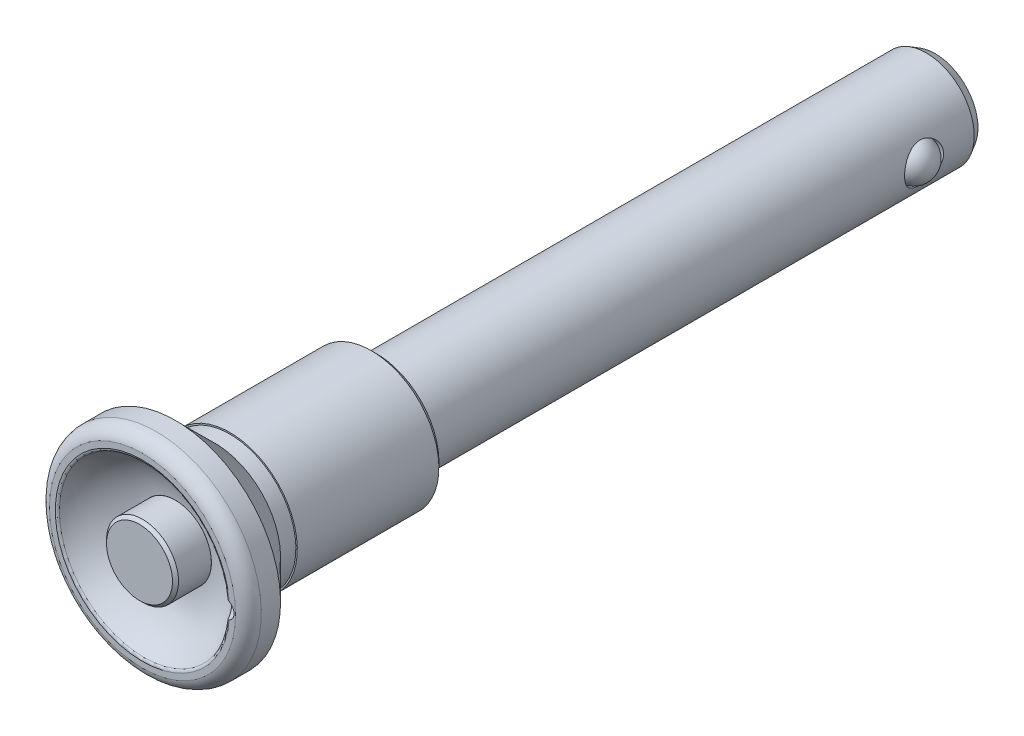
ISO-10303-21;
HEADER;
FILE_DESCRIPTION(('STEP AP214'),'2;1');
FILE_NAME('part.step','',(''),(''),'','','');
FILE_SCHEMA(('AUTOMOTIVE_DESIGN { 1 0 10303 214 1 1 1 1 }'));
ENDSEC;
DATA;
#1=APPLICATION_CONTEXT('core data for automotive mechanical design processes');
#2=APPLICATION_PROTOCOL_DEFINITION('international standard','automotive_design',2000,#1);
#3=PRODUCT_CONTEXT('',#1,'mechanical');
#4=PRODUCT('Part','Part','',(#3));
#5=PRODUCT_RELATED_PRODUCT_CATEGORY('part','',(#4));
#6=PRODUCT_DEFINITION_FORMATION('','',#4);
#7=PRODUCT_DEFINITION_CONTEXT('part definition',#1,'design');
#8=PRODUCT_DEFINITION('design','',#6,#7);
#9=PRODUCT_DEFINITION_SHAPE('','',#8);
#10=(LENGTH_UNIT() NAMED_UNIT(*) SI_UNIT(.MILLI.,.METRE.));
#11=(NAMED_UNIT(*) PLANE_ANGLE_UNIT() SI_UNIT($,.RADIAN.));
#12=(NAMED_UNIT(*) SI_UNIT($,.STERADIAN.) SOLID_ANGLE_UNIT());
#13=UNCERTAINTY_MEASURE_WITH_UNIT(LENGTH_MEASURE(1.E-05),#10,'distance_accuracy_value','');
#14=(GEOMETRIC_REPRESENTATION_CONTEXT(3) GLOBAL_UNCERTAINTY_ASSIGNED_CONTEXT((#13)) GLOBAL_UNIT_ASSIGNED_CONTEXT((#10,
#11,#12)) REPRESENTATION_CONTEXT('',''));
#15=CARTESIAN_POINT('',(0.,0.,0.));
#16=DIRECTION('',(0.,0.,1.));
#17=DIRECTION('',(1.,0.,0.));
#18=AXIS2_PLACEMENT_3D('',#15,#16,#17);
#19=CARTESIAN_POINT('',(9.,0.,-83.25));
#20=DIRECTION('',(1.,0.,0.));
#21=DIRECTION('',(0.,1.,0.));
#22=AXIS2_PLACEMENT_3D('',#19,#20,#21);
#23=CYLINDRICAL_SURFACE('',#22,3.25);
#24=CARTESIAN_POINT('',(-5.63465480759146,3.25,-83.25));
#25=CARTESIAN_POINT('',(-5.63465585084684,3.24999903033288,-83.3347265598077));
#26=CARTESIAN_POINT('',(-5.63657454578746,3.24668003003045,-83.4194635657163));
#27=CARTESIAN_POINT('',(-5.64416687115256,3.23345980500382,-83.5882644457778));
#28=CARTESIAN_POINT('',(-5.64984225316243,3.22355550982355,-83.6723279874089));
#29=CARTESIAN_POINT('',(-5.67225088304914,3.1840842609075,-83.9227685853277));
#30=CARTESIAN_POINT('',(-5.6943660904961,3.14475922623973,-84.0872467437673));
#31=CARTESIAN_POINT('',(-5.74975810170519,3.04227249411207,-84.4053993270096));
#32=CARTESIAN_POINT('',(-5.78297553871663,2.97923736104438,-84.5591260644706));
#33=CARTESIAN_POINT('',(-5.85672343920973,2.8315067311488,-84.8538197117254));
#34=CARTESIAN_POINT('',(-5.89725428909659,2.74681008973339,-84.994785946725));
#35=CARTESIAN_POINT('',(-5.98514477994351,2.54998143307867,-85.2727307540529));
#36=CARTESIAN_POINT('',(-6.03279191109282,2.4361644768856,-85.4084249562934));
#37=CARTESIAN_POINT('',(-6.12722511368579,2.18783002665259,-85.6597995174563));
#38=CARTESIAN_POINT('',(-6.17401074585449,2.05330228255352,-85.7754699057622));
#39=CARTESIAN_POINT('',(-6.26521517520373,1.75630332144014,-85.9911271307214));
#40=CARTESIAN_POINT('',(-6.30926291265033,1.59256097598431,-86.0895350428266));
#41=CARTESIAN_POINT('',(-6.38629670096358,1.24823211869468,-86.2568223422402));
#42=CARTESIAN_POINT('',(-6.41928971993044,1.06765630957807,-86.3257203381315));
#43=CARTESIAN_POINT('',(-6.46842511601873,0.708385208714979,-86.426948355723));
#44=CARTESIAN_POINT('',(-6.48559839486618,0.530468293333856,-86.4615292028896));
#45=CARTESIAN_POINT('',(-6.50500792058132,0.17059293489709,-86.5005535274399));
#46=CARTESIAN_POINT('',(-6.50725319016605,-0.0113630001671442,-86.5050152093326));
#47=CARTESIAN_POINT('',(-6.49704272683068,-0.357230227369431,-86.4845439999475));
#48=CARTESIAN_POINT('',(-6.4858466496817,-0.521336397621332,-86.462129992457));
#49=CARTESIAN_POINT('',(-6.45191454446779,-0.843095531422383,-86.3930510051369));
#50=CARTESIAN_POINT('',(-6.42917765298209,-1.00074801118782,-86.3463842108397));
#51=CARTESIAN_POINT('',(-6.37385308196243,-1.30787680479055,-86.2298199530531));
#52=CARTESIAN_POINT('',(-6.3411333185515,-1.45720962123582,-86.1596096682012));
#53=CARTESIAN_POINT('',(-6.26879358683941,-1.74233451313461,-85.9983862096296));
#54=CARTESIAN_POINT('',(-6.22917114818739,-1.8781217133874,-85.907365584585));
#55=CARTESIAN_POINT('',(-6.14233091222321,-2.14598519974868,-85.6972203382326));
#56=CARTESIAN_POINT('',(-6.09474919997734,-2.27650038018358,-85.5762535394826));
#57=CARTESIAN_POINT('',(-5.99975905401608,-2.5162242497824,-85.3146223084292));
#58=CARTESIAN_POINT('',(-5.95235078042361,-2.62541658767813,-85.1739429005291));
#59=CARTESIAN_POINT('',(-5.85980562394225,-2.82622074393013,-84.8657980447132));
#60=CARTESIAN_POINT('',(-5.81500282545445,-2.91628088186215,-84.6972003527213));
#61=CARTESIAN_POINT('',(-5.75683713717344,-3.02860289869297,-84.4329042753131));
#62=CARTESIAN_POINT('',(-5.73895226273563,-3.06225341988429,-84.3428861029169));
#63=CARTESIAN_POINT('',(-5.70689630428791,-3.12158760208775,-84.1596398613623));
#64=CARTESIAN_POINT('',(-5.69272293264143,-3.14727617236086,-84.0664138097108));
#65=CARTESIAN_POINT('',(-5.66966031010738,-3.18862076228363,-83.8849536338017));
#66=CARTESIAN_POINT('',(-5.66044290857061,-3.2049073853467,-83.7969042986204));
#67=CARTESIAN_POINT('',(-5.64606365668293,-3.23017214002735,-83.6194752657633));
#68=CARTESIAN_POINT('',(-5.64089969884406,-3.23915406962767,-83.5300962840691));
#69=CARTESIAN_POINT('',(-5.63484456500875,-3.24967714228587,-83.3507836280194));
#70=CARTESIAN_POINT('',(-5.63395180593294,-3.25122104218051,-83.2608501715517));
#71=CARTESIAN_POINT('',(-5.63646392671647,-3.24686086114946,-83.0812524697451));
#72=CARTESIAN_POINT('',(-5.63986851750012,-3.24095728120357,-82.9915882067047));
#73=CARTESIAN_POINT('',(-5.65514884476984,-3.21427724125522,-82.7437015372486));
#74=CARTESIAN_POINT('',(-5.67155983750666,-3.18549325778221,-82.5865355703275));
#75=CARTESIAN_POINT('',(-5.71556614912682,-3.10582623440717,-82.2796654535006));
#76=CARTESIAN_POINT('',(-5.74316508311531,-3.05493605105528,-82.1299637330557));
#77=CARTESIAN_POINT('',(-5.80791715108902,-2.93003236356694,-81.8342513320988));
#78=CARTESIAN_POINT('',(-5.84545364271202,-2.85505691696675,-81.6887328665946));
#79=CARTESIAN_POINT('',(-5.92551444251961,-2.68494755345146,-81.4115097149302));
#80=CARTESIAN_POINT('',(-5.96804130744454,-2.58980328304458,-81.2798121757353));
#81=CARTESIAN_POINT('',(-6.0597218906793,-2.36806394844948,-81.0166221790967));
#82=CARTESIAN_POINT('',(-6.10903611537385,-2.23901784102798,-80.8872408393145));
#83=CARTESIAN_POINT('',(-6.20410028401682,-1.96026914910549,-80.6513088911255));
#84=CARTESIAN_POINT('',(-6.24984902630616,-1.81055964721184,-80.5447659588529));
#85=CARTESIAN_POINT('',(-6.33418834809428,-1.48934321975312,-80.3551748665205));
#86=CARTESIAN_POINT('',(-6.3725595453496,-1.31736733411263,-80.272816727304));
#87=CARTESIAN_POINT('',(-6.43615086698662,-0.959533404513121,-80.1390207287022));
#88=CARTESIAN_POINT('',(-6.46138252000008,-0.773687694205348,-80.0875557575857));
#89=CARTESIAN_POINT('',(-6.49401408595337,-0.411781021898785,-80.0214370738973));
#90=CARTESIAN_POINT('',(-6.50283657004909,-0.236384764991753,-80.0038414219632));
#91=CARTESIAN_POINT('',(-6.50610717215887,0.115050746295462,-79.9972911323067));
#92=CARTESIAN_POINT('',(-6.50056030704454,0.291089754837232,-80.0083264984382));
#93=CARTESIAN_POINT('',(-6.47654468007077,0.626628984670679,-80.0567749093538));
#94=CARTESIAN_POINT('',(-6.4589493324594,0.786455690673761,-80.0924062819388));
#95=CARTESIAN_POINT('',(-6.41341105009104,1.09760306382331,-80.1866353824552));
#96=CARTESIAN_POINT('',(-6.38546662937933,1.24892250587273,-80.2452364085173));
#97=CARTESIAN_POINT('',(-6.32026378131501,1.54603651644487,-80.3863521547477));
#98=CARTESIAN_POINT('',(-6.28265782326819,1.6913172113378,-80.4697832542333));
#99=CARTESIAN_POINT('',(-6.20206440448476,1.96642117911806,-80.65704730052));
#100=CARTESIAN_POINT('',(-6.15907447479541,2.09623730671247,-80.7608896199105));
#101=CARTESIAN_POINT('',(-6.06695065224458,2.35031327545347,-80.9979647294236));
#102=CARTESIAN_POINT('',(-6.01763078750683,2.47273842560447,-81.1330928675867));
#103=CARTESIAN_POINT('',(-5.92193632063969,2.69389263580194,-81.4228073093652));
#104=CARTESIAN_POINT('',(-5.87556434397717,2.79260078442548,-81.5774106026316));
#105=CARTESIAN_POINT('',(-5.81174828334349,2.92195709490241,-81.8239315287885));
#106=CARTESIAN_POINT('',(-5.7911601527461,2.96243340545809,-81.91000421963));
#107=CARTESIAN_POINT('',(-5.75300321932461,3.03586895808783,-82.0859253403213));
#108=CARTESIAN_POINT('',(-5.73543286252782,3.0688320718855,-82.175771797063));
#109=CARTESIAN_POINT('',(-5.70405555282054,3.1267666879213,-82.3583807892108));
#110=CARTESIAN_POINT('',(-5.69023892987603,3.15175875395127,-82.4511351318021));
#111=CARTESIAN_POINT('',(-5.66692413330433,3.19349036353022,-82.6389664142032));
#112=CARTESIAN_POINT('',(-5.65742293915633,3.21023567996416,-82.7340416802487));
#113=CARTESIAN_POINT('',(-5.64512882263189,3.23178897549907,-82.8993457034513));
#114=CARTESIAN_POINT('',(-5.6412106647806,3.23861149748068,-82.9692357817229));
#115=CARTESIAN_POINT('',(-5.63597313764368,3.24771756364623,-83.1094148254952));
#116=CARTESIAN_POINT('',(-5.63465394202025,3.25000080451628,-83.1797038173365));
#117=CARTESIAN_POINT('',(-5.63465480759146,3.25,-83.25));
#118=B_SPLINE_CURVE_WITH_KNOTS('',3,(#24,#25,#26,#27,#28,#29,#30,#31,#32,#33,#34,#35,#36,#37,
#38,#39,#40,#41,#42,#43,#44,#45,#46,#47,#48,#49,#50,#51,#52,#53,#54,#55,#56,#57,#58,#59,#60,#61,
#62,#63,#64,#65,#66,#67,#68,#69,#70,#71,#72,#73,#74,#75,#76,#77,#78,#79,#80,#81,#82,#83,#84,#85,
#86,#87,#88,#89,#90,#91,#92,#93,#94,#95,#96,#97,#98,#99,#100,#101,#102,#103,#104,#105,#106,#107,
#108,#109,#110,#111,#112,#113,#114,#115,#116,#117),.UNSPECIFIED.,.T.,.F.,(4,2,2,2,2,2,2,2,2,2,2,
2,2,2,2,2,2,2,2,2,2,2,2,2,2,2,2,2,2,2,2,2,2,2,2,2,2,2,2,2,2,2,2,2,2,2,4),(0.,0.254102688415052,
0.508323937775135,1.01720671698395,1.52341076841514,2.0296415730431,2.57756086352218,
3.1257522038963,3.71082834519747,4.29553499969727,4.8386878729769,5.38151242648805,
5.87719988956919,6.37292444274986,6.87551542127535,7.37828663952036,7.92853225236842,
8.47919817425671,9.06474424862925,9.35763698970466,9.65034877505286,9.9200168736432,
10.1895446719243,10.4589725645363,10.7283823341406,11.2078563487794,11.6874854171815,
12.189332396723,12.6914376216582,13.2567245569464,13.8222011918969,14.4025190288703,
14.982326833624,15.5089851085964,16.0354595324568,16.5273252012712,17.0192615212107,
17.5322584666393,18.0454915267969,18.6097361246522,19.1744764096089,19.4660899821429,
19.7575529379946,20.0482577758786,20.3387588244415,20.5495694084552,20.7603940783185),.UNSPECIFIED.);
#119=CARTESIAN_POINT('',(-6.04146080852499,-2.41093054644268,-85.429429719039));
#120=VERTEX_POINT('',#119);
#121=CARTESIAN_POINT('',(-6.04146080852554,2.41093054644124,-85.4294297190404));
#122=VERTEX_POINT('',#121);
#123=EDGE_CURVE('E78',#120,#122,#118,.T.);
#124=ORIENTED_EDGE('',*,*,#123,.F.);
#125=CARTESIAN_POINT('',(-6.50475478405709,0.,-86.5));
#126=CARTESIAN_POINT('',(-6.50475472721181,-0.182431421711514,-86.4999918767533));
#127=CARTESIAN_POINT('',(-6.50415200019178,-0.364995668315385,-86.4845876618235));
#128=CARTESIAN_POINT('',(-6.50173100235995,-0.725096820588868,-86.4233526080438));
#129=CARTESIAN_POINT('',(-6.49991125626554,-0.902627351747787,-86.3774848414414));
#130=CARTESIAN_POINT('',(-6.49502786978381,-1.24739374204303,-86.2566336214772));
#131=CARTESIAN_POINT('',(-6.49196480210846,-1.41463430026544,-86.1816635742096));
#132=CARTESIAN_POINT('',(-6.48454055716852,-1.73409069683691,-86.0047703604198));
#133=CARTESIAN_POINT('',(-6.48017978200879,-1.88631116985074,-85.9028555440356));
#134=CARTESIAN_POINT('',(-6.47005616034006,-2.17150162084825,-85.6749545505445));
#135=CARTESIAN_POINT('',(-6.46429309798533,-2.30446863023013,-85.5489646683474));
#136=CARTESIAN_POINT('',(-6.45117895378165,-2.54740669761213,-85.2764608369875));
#137=CARTESIAN_POINT('',(-6.44382727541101,-2.65736908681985,-85.1299391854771));
#138=CARTESIAN_POINT('',(-6.42714023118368,-2.8512229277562,-84.8204831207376));
#139=CARTESIAN_POINT('',(-6.41780288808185,-2.935088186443,-84.6575324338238));
#140=CARTESIAN_POINT('',(-6.39637595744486,-3.07415122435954,-84.3201765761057));
#141=CARTESIAN_POINT('',(-6.38429049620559,-3.12939158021,-84.1457888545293));
#142=CARTESIAN_POINT('',(-6.36213145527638,-3.18943231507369,-83.8809438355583));
#143=CARTESIAN_POINT('',(-6.35414445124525,-3.20560626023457,-83.7927604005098));
#144=CARTESIAN_POINT('',(-6.33542581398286,-3.23060141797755,-83.6156617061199));
#145=CARTESIAN_POINT('',(-6.32469468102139,-3.239423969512,-83.5267465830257));
#146=CARTESIAN_POINT('',(-6.30342598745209,-3.24711535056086,-83.3937912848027));
#147=CARTESIAN_POINT('',(-6.29549176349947,-3.24875723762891,-83.3496150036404));
#148=CARTESIAN_POINT('',(-6.27882947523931,-3.24969197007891,-83.2959956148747));
#149=CARTESIAN_POINT('',(-6.27515773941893,-3.24982305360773,-83.2853466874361));
#150=CARTESIAN_POINT('',(-6.26890017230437,-3.24992109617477,-83.2727940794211));
#151=CARTESIAN_POINT('',(-6.26755615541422,-3.24993748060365,-83.2703066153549));
#152=CARTESIAN_POINT('',(-6.26457757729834,-3.24996385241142,-83.2655076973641));
#153=CARTESIAN_POINT('',(-6.26294427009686,-3.24997386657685,-83.2631955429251));
#154=CARTESIAN_POINT('',(-6.26029966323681,-3.2499838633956,-83.2602771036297));
#155=CARTESIAN_POINT('',(-6.25950365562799,-3.24998625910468,-83.259480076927));
#156=CARTESIAN_POINT('',(-6.25780472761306,-3.24999021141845,-83.2580094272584));
#157=CARTESIAN_POINT('',(-6.25690222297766,-3.24999177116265,-83.2573353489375));
#158=CARTESIAN_POINT('',(-6.25538170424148,-3.24999365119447,-83.2564327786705));
#159=CARTESIAN_POINT('',(-6.25480452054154,-3.2499942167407,-83.2561363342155));
#160=CARTESIAN_POINT('',(-6.25361148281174,-3.2499951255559,-83.2556343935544));
#161=CARTESIAN_POINT('',(-6.25299567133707,-3.24999546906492,-83.2554287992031));
#162=CARTESIAN_POINT('',(-6.25172949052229,-3.2499959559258,-83.2551293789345));
#163=CARTESIAN_POINT('',(-6.25107882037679,-3.24999609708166,-83.2550367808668));
#164=CARTESIAN_POINT('',(-6.24977202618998,-3.24999618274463,-83.2549813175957));
#165=CARTESIAN_POINT('',(-6.24911590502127,-3.24999612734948,-83.2550183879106));
#166=CARTESIAN_POINT('',(-6.24790373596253,-3.24999583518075,-83.2552035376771));
#167=CARTESIAN_POINT('',(-6.2473453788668,-3.24999562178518,-83.2553372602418));
#168=CARTESIAN_POINT('',(-6.2462549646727,-3.24999503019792,-83.2556861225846));
#169=CARTESIAN_POINT('',(-6.24572292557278,-3.24999465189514,-83.2559013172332));
#170=CARTESIAN_POINT('',(-6.24435696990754,-3.24999341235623,-83.2565561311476));
#171=CARTESIAN_POINT('',(-6.24354975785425,-3.24999239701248,-83.2570509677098));
#172=CARTESIAN_POINT('',(-6.2420185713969,-3.24998981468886,-83.2581558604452));
#173=CARTESIAN_POINT('',(-6.24129488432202,-3.24998824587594,-83.2587662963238));
#174=CARTESIAN_POINT('',(-6.23885580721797,-3.24998160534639,-83.2610537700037));
#175=CARTESIAN_POINT('',(-6.23732819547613,-3.24997485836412,-83.2629265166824));
#176=CARTESIAN_POINT('',(-6.23453858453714,-3.24995689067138,-83.2668604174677));
#177=CARTESIAN_POINT('',(-6.23327848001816,-3.24994563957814,-83.2689227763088));
#178=CARTESIAN_POINT('',(-6.2275407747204,-3.24987933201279,-83.2791362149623));
#179=CARTESIAN_POINT('',(-6.22414293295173,-3.24979089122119,-83.2878680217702));
#180=CARTESIAN_POINT('',(-6.21809518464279,-3.24953787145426,-83.3055431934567));
#181=CARTESIAN_POINT('',(-6.21544772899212,-3.24937304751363,-83.3144871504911));
#182=CARTESIAN_POINT('',(-6.20329024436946,-3.24836406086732,-83.359005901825));
#183=CARTESIAN_POINT('',(-6.19656627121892,-3.24694993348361,-83.3953332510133));
#184=CARTESIAN_POINT('',(-6.18452276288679,-3.24287823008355,-83.4681644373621));
#185=CARTESIAN_POINT('',(-6.17920844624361,-3.24021613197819,-83.5046684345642));
#186=CARTESIAN_POINT('',(-6.16455650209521,-3.23031427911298,-83.6146776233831));
#187=CARTESIAN_POINT('',(-6.15659209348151,-3.22116857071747,-83.6882307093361));
#188=CARTESIAN_POINT('',(-6.14213641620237,-3.19786349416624,-83.8345240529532));
#189=CARTESIAN_POINT('',(-6.13564314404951,-3.18371101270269,-83.9072652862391));
#190=CARTESIAN_POINT('',(-6.11756290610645,-3.13371051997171,-84.1243002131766));
#191=CARTESIAN_POINT('',(-6.10741258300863,-3.09035068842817,-84.2670577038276));
#192=CARTESIAN_POINT('',(-6.08705596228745,-2.97250185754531,-84.5766439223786));
#193=CARTESIAN_POINT('',(-6.07734814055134,-2.89321109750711,-84.7416864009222));
#194=CARTESIAN_POINT('',(-6.0600012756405,-2.70803402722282,-85.0561997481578));
#195=CARTESIAN_POINT('',(-6.05236213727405,-2.60214894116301,-85.2056713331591));
#196=CARTESIAN_POINT('',(-6.03871394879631,-2.36675113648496,-85.484797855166));
#197=CARTESIAN_POINT('',(-6.03270506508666,-2.23723600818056,-85.6144507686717));
#198=CARTESIAN_POINT('',(-6.02211352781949,-1.95825322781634,-85.8502113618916));
#199=CARTESIAN_POINT('',(-6.01753088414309,-1.80878543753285,-85.9563188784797));
#200=CARTESIAN_POINT('',(-6.00967850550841,-1.4941417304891,-86.1419551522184));
#201=CARTESIAN_POINT('',(-6.00640873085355,-1.32896628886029,-86.2214847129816));
#202=CARTESIAN_POINT('',(-6.00112064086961,-0.987593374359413,-86.3516982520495));
#203=CARTESIAN_POINT('',(-5.99910232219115,-0.811395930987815,-86.4023823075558));
#204=CARTESIAN_POINT('',(-5.99628586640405,-0.453052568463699,-86.4734446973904));
#205=CARTESIAN_POINT('',(-5.99548726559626,-0.270908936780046,-86.4938345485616));
#206=CARTESIAN_POINT('',(-5.99509745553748,0.0942183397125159,-86.5037635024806));
#207=CARTESIAN_POINT('',(-5.99550624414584,0.277201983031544,-86.4933026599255));
#208=CARTESIAN_POINT('',(-5.99753672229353,0.638781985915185,-86.4418331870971));
#209=CARTESIAN_POINT('',(-5.99915820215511,0.817379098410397,-86.4008298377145));
#210=CARTESIAN_POINT('',(-6.00363843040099,1.16515467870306,-86.2894496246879));
#211=CARTESIAN_POINT('',(-6.00649721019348,1.33433290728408,-86.2190720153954));
#212=CARTESIAN_POINT('',(-6.0135025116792,1.65849568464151,-86.0509346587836));
#213=CARTESIAN_POINT('',(-6.01764926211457,1.81347770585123,-85.9531700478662));
#214=CARTESIAN_POINT('',(-6.0273234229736,2.1047933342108,-85.7330763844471));
#215=CARTESIAN_POINT('',(-6.03285058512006,2.24113028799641,-85.6107517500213));
#216=CARTESIAN_POINT('',(-6.04544982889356,2.49132905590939,-85.3450117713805));
#217=CARTESIAN_POINT('',(-6.05252187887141,2.60519133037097,-85.2015968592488));
#218=CARTESIAN_POINT('',(-6.06857069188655,2.8073171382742,-84.8976741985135));
#219=CARTESIAN_POINT('',(-6.07754918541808,2.8955572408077,-84.7371509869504));
#220=CARTESIAN_POINT('',(-6.09807707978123,3.04397016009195,-84.4033061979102));
#221=CARTESIAN_POINT('',(-6.10963108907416,3.10409205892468,-84.2299620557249));
#222=CARTESIAN_POINT('',(-6.13064936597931,3.17169375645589,-83.9649701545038));
#223=CARTESIAN_POINT('',(-6.13825974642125,3.19045596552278,-83.8759096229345));
#224=CARTESIAN_POINT('',(-6.15556946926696,3.22042544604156,-83.6967504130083));
#225=CARTESIAN_POINT('',(-6.16526748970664,3.23163748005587,-83.6066524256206));
#226=CARTESIAN_POINT('',(-6.18408699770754,3.24288271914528,-83.4699792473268));
#227=CARTESIAN_POINT('',(-6.19122596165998,3.24569959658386,-83.4233942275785));
#228=CARTESIAN_POINT('',(-6.20522823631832,3.24841427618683,-83.3541203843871));
#229=CARTESIAN_POINT('',(-6.21044556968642,3.2490673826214,-83.3311266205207));
#230=CARTESIAN_POINT('',(-6.22071764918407,3.24967689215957,-83.2971645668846));
#231=CARTESIAN_POINT('',(-6.22455261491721,3.24981834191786,-83.2859249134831));
#232=CARTESIAN_POINT('',(-6.23115042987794,3.24992193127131,-83.2726935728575));
#233=CARTESIAN_POINT('',(-6.23257343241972,3.24993908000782,-83.2700667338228));
#234=CARTESIAN_POINT('',(-6.23574861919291,3.249966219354,-83.2650204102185));
#235=CARTESIAN_POINT('',(-6.2374982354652,3.24997626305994,-83.2625995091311));
#236=CARTESIAN_POINT('',(-6.24023323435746,3.24998546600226,-83.259747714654));
#237=CARTESIAN_POINT('',(-6.24095037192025,3.24998741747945,-83.2590662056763));
#238=CARTESIAN_POINT('',(-6.24247036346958,3.2499906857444,-83.2578055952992));
#239=CARTESIAN_POINT('',(-6.24327303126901,3.24999200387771,-83.2572262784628));
#240=CARTESIAN_POINT('',(-6.24469100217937,3.24999372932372,-83.2563932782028));
#241=CARTESIAN_POINT('',(-6.24527994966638,3.24999429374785,-83.2560953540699));
#242=CARTESIAN_POINT('',(-6.24649738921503,3.24999519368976,-83.2555949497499));
#243=CARTESIAN_POINT('',(-6.2471258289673,3.24999552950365,-83.2553923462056));
#244=CARTESIAN_POINT('',(-6.24841731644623,3.24999599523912,-83.2551042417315));
#245=CARTESIAN_POINT('',(-6.24908067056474,3.24999612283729,-83.2550200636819));
#246=CARTESIAN_POINT('',(-6.25041071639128,3.24999617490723,-83.2549864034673));
#247=CARTESIAN_POINT('',(-6.25107740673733,3.24999609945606,-83.2550368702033));
#248=CARTESIAN_POINT('',(-6.2522960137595,3.24999576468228,-83.2552474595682));
#249=CARTESIAN_POINT('',(-6.25285091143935,3.24999553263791,-83.2553912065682));
#250=CARTESIAN_POINT('',(-6.25393339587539,3.24999490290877,-83.2557583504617));
#251=CARTESIAN_POINT('',(-6.25446096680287,3.24999450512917,-83.25598179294));
#252=CARTESIAN_POINT('',(-6.25583840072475,3.24999318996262,-83.256667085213));
#253=CARTESIAN_POINT('',(-6.256659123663,3.24999210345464,-83.2571869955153));
#254=CARTESIAN_POINT('',(-6.2582140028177,3.24998934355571,-83.2583432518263));
#255=CARTESIAN_POINT('',(-6.2589478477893,3.24998766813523,-83.2589799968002));
#256=CARTESIAN_POINT('',(-6.26145971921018,3.24998046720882,-83.2613987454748));
#257=CARTESIAN_POINT('',(-6.2630348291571,3.2499730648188,-83.2633865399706));
#258=CARTESIAN_POINT('',(-6.26590679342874,3.24995329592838,-83.2675538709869));
#259=CARTESIAN_POINT('',(-6.26720163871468,3.24994089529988,-83.2697346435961));
#260=CARTESIAN_POINT('',(-6.2732032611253,3.24986641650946,-83.2807202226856));
#261=CARTESIAN_POINT('',(-6.27673982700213,3.24976552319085,-83.2901364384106));
#262=CARTESIAN_POINT('',(-6.28303094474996,3.24947572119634,-83.3091775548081));
#263=CARTESIAN_POINT('',(-6.28578309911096,3.24928654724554,-83.3188030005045));
#264=CARTESIAN_POINT('',(-6.29841795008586,3.24812694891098,-83.3667085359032));
#265=CARTESIAN_POINT('',(-6.30538389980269,3.24649816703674,-83.4057506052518));
#266=CARTESIAN_POINT('',(-6.31786268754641,3.2418065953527,-83.4839948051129));
#267=CARTESIAN_POINT('',(-6.32337031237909,3.23873876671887,-83.5231970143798));
#268=CARTESIAN_POINT('',(-6.33857182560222,3.22731083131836,-83.6414665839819));
#269=CARTESIAN_POINT('',(-6.34682941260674,3.21674112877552,-83.7205459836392));
#270=CARTESIAN_POINT('',(-6.36180806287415,3.18980788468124,-83.8776933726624));
#271=CARTESIAN_POINT('',(-6.36853100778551,3.17345150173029,-83.9557624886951));
#272=CARTESIAN_POINT('',(-6.38722831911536,3.11568291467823,-84.1883617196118));
#273=CARTESIAN_POINT('',(-6.39769866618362,3.06560179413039,-84.3409675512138));
#274=CARTESIAN_POINT('',(-6.41649095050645,2.94356822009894,-84.6369097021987));
#275=CARTESIAN_POINT('',(-6.42481661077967,2.87165414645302,-84.7802617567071));
#276=CARTESIAN_POINT('',(-6.4398810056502,2.70750791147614,-85.0548470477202));
#277=CARTESIAN_POINT('',(-6.44662026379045,2.61528247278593,-85.1860842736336));
#278=CARTESIAN_POINT('',(-6.45968563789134,2.39819149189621,-85.4510135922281));
#279=CARTESIAN_POINT('',(-6.46582082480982,2.2705610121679,-85.58246220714));
#280=CARTESIAN_POINT('',(-6.47665599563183,1.99493696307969,-85.82218121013));
#281=CARTESIAN_POINT('',(-6.4813549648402,1.84692910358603,-85.9304351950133));
#282=CARTESIAN_POINT('',(-6.4894329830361,1.53479241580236,-86.1205971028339));
#283=CARTESIAN_POINT('',(-6.49281172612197,1.37065986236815,-86.2024989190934));
#284=CARTESIAN_POINT('',(-6.49830922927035,1.03110256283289,-86.3374958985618));
#285=CARTESIAN_POINT('',(-6.50042961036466,0.855692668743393,-86.3906281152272));
#286=CARTESIAN_POINT('',(-6.50287966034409,0.565964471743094,-86.4523665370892));
#287=CARTESIAN_POINT('',(-6.50358302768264,0.453533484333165,-86.4702066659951));
#288=CARTESIAN_POINT('',(-6.50452060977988,0.227418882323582,-86.4940259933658));
#289=CARTESIAN_POINT('',(-6.50475481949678,0.113735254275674,-86.5000050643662));
#290=CARTESIAN_POINT('',(-6.50475478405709,0.,-86.5));
#291=B_SPLINE_CURVE_WITH_KNOTS('',3,(#125,#126,#127,#128,#129,#130,#131,#132,#133,#134,#135,
#136,#137,#138,#139,#140,#141,#142,#143,#144,#145,#146,#147,#148,#149,#150,#151,#152,#153,#154,
#155,#156,#157,#158,#159,#160,#161,#162,#163,#164,#165,#166,#167,#168,#169,#170,#171,#172,#173,
#174,#175,#176,#177,#178,#179,#180,#181,#182,#183,#184,#185,#186,#187,#188,#189,#190,#191,#192,
#193,#194,#195,#196,#197,#198,#199,#200,#201,#202,#203,#204,#205,#206,#207,#208,#209,#210,#211,
#212,#213,#214,#215,#216,#217,#218,#219,#220,#221,#222,#223,#224,#225,#226,#227,#228,#229,#230,
#231,#232,#233,#234,#235,#236,#237,#238,#239,#240,#241,#242,#243,#244,#245,#246,#247,#248,#249,
#250,#251,#252,#253,#254,#255,#256,#257,#258,#259,#260,#261,#262,#263,#264,#265,#266,#267,#268,
#269,#270,#271,#272,#273,#274,#275,#276,#277,#278,#279,#280,#281,#282,#283,#284,#285,#286,#287,
#288,#289,#290),.UNSPECIFIED.,.T.,.F.,(4,2,2,2,2,2,2,2,2,2,2,2,2,2,2,2,2,2,2,2,2,2,2,2,2,2,2,2,
2,2,2,2,2,2,2,2,2,2,2,2,2,2,2,2,2,2,2,2,2,2,2,2,2,2,2,2,2,2,2,2,2,2,2,2,2,2,2,2,2,2,2,2,2,2,2,2,
2,2,2,2,2,2,4),(0.,0.546878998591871,1.09442213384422,1.64171333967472,2.18883513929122,
2.73604120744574,3.28345310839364,3.83141267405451,4.37855484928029,4.64829359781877,
4.91798320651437,5.05238497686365,5.08600715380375,5.09448207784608,5.10292112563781,
5.10629355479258,5.10965322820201,5.11159396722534,5.11353260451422,5.11549212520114,
5.11745067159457,5.11916600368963,5.12088249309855,5.12370644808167,5.12653984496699,
5.13373370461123,5.14097693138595,5.16888967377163,5.19689256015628,5.30747569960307,
5.41846267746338,5.64180446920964,5.86484024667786,6.31195514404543,6.85939401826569,
7.40680769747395,7.95427723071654,8.50175055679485,9.04920732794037,9.59666263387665,
10.1439097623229,10.6911559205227,11.2383074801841,11.7854729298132,12.3327356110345,
12.879899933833,13.427053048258,13.9747049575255,14.5233447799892,14.7970709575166,
15.0706243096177,15.2120965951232,15.2828520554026,15.3182754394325,15.3272316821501,
15.3361202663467,15.3390824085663,15.3420382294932,15.3440119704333,15.3459831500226,
15.3479761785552,15.3499684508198,15.3516812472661,15.3533950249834,15.3562927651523,
15.3592005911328,15.3667496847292,15.3743512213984,15.4043178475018,15.4343751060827,
15.5531053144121,15.672254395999,15.912531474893,16.1525123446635,16.6334226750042,
17.1134924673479,17.5934036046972,18.1407106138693,18.688403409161,19.2362230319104,
19.7833354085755,20.1242786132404,20.465225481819),.UNSPECIFIED.);
#292=EDGE_CURVE('E62',#122,#120,#291,.T.);
#293=ORIENTED_EDGE('',*,*,#292,.F.);
#294=EDGE_LOOP('',(#124,#293));
#295=FACE_BOUND('',#294,.T.);
#296=CARTESIAN_POINT('',(-7.31009575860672,3.25,-83.25));
#297=CARTESIAN_POINT('',(-7.31009732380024,3.24999819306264,-83.1630599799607));
#298=CARTESIAN_POINT('',(-7.31165386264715,3.24650411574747,-83.076090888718));
#299=CARTESIAN_POINT('',(-7.31782159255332,3.23257358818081,-82.9028024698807));
#300=CARTESIAN_POINT('',(-7.3224347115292,3.22213275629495,-82.8164835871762));
#301=CARTESIAN_POINT('',(-7.34068494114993,3.18046303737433,-82.5591175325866));
#302=CARTESIAN_POINT('',(-7.35873227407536,3.13888730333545,-82.3899262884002));
#303=CARTESIAN_POINT('',(-7.40417815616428,3.03010582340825,-82.062264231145));
#304=CARTESIAN_POINT('',(-7.43153982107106,2.96300104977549,-81.903754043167));
#305=CARTESIAN_POINT('',(-7.49246721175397,2.80536216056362,-81.6002509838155));
#306=CARTESIAN_POINT('',(-7.5260312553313,2.71483439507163,-81.4552544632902));
#307=CARTESIAN_POINT('',(-7.59780469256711,2.50719740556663,-81.174284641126));
#308=CARTESIAN_POINT('',(-7.63616661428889,2.38892405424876,-81.0392107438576));
#309=CARTESIAN_POINT('',(-7.71195570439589,2.13160039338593,-80.790151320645));
#310=CARTESIAN_POINT('',(-7.74938251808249,1.99254233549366,-80.6761736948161));
#311=CARTESIAN_POINT('',(-7.82092244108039,1.69061377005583,-80.4680431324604));
#312=CARTESIAN_POINT('',(-7.85483757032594,1.52700226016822,-80.3748909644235));
#313=CARTESIAN_POINT('',(-7.91367836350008,1.18480623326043,-80.2178173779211));
#314=CARTESIAN_POINT('',(-7.93860783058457,1.00622809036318,-80.1538835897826));
#315=CARTESIAN_POINT('',(-7.97558858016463,0.648594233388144,-80.0602869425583));
#316=CARTESIAN_POINT('',(-7.98821898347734,0.470004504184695,-80.0290769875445));
#317=CARTESIAN_POINT('',(-8.00127556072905,0.10970598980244,-79.9968257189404));
#318=CARTESIAN_POINT('',(-8.00170642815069,-0.0720015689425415,-79.9957728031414));
#319=CARTESIAN_POINT('',(-7.99066355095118,-0.422169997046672,-80.0230312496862));
#320=CARTESIAN_POINT('',(-7.97987772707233,-0.590788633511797,-80.0496457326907));
#321=CARTESIAN_POINT('',(-7.94854711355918,-0.920926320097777,-80.1285888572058));
#322=CARTESIAN_POINT('',(-7.92800160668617,-1.08244484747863,-80.1809193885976));
#323=CARTESIAN_POINT('',(-7.87875951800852,-1.39673026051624,-80.3104453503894));
#324=CARTESIAN_POINT('',(-7.84994411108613,-1.54932739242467,-80.3880056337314));
#325=CARTESIAN_POINT('',(-7.78700709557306,-1.83973693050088,-80.5654420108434));
#326=CARTESIAN_POINT('',(-7.75288364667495,-1.97754418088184,-80.6653258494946));
#327=CARTESIAN_POINT('',(-7.68006213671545,-2.2443353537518,-80.8924212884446));
#328=CARTESIAN_POINT('',(-7.6412107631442,-2.37209684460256,-81.0210218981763));
#329=CARTESIAN_POINT('',(-7.56507027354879,-2.60475126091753,-81.2979515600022));
#330=CARTESIAN_POINT('',(-7.52778170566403,-2.70963621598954,-81.4462874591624));
#331=CARTESIAN_POINT('',(-7.45792668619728,-2.89648137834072,-81.7641116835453));
#332=CARTESIAN_POINT('',(-7.42553491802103,-2.97766171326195,-81.9341001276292));
#333=CARTESIAN_POINT('',(-7.37120049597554,-3.10975325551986,-82.2870012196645));
#334=CARTESIAN_POINT('',(-7.34925080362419,-3.16068485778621,-82.4699050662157));
#335=CARTESIAN_POINT('',(-7.32000769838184,-3.22780941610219,-82.8312282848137));
#336=CARTESIAN_POINT('',(-7.31188362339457,-3.24597550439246,-83.009212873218));
#337=CARTESIAN_POINT('',(-7.30884184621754,-3.25282336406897,-83.365834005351));
#338=CARTESIAN_POINT('',(-7.31391993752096,-3.24151452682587,-83.544470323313));
#339=CARTESIAN_POINT('',(-7.33585566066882,-3.19153169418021,-83.8861339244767));
#340=CARTESIAN_POINT('',(-7.35199401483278,-3.15452692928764,-84.0494573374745));
#341=CARTESIAN_POINT('',(-7.39332962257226,-3.05638531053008,-84.3674592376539));
#342=CARTESIAN_POINT('',(-7.41852892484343,-2.99524299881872,-84.522135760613));
#343=CARTESIAN_POINT('',(-7.47641704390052,-2.84775217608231,-84.8255746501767));
#344=CARTESIAN_POINT('',(-7.50937194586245,-2.76046786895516,-84.9738297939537));
#345=CARTESIAN_POINT('',(-7.57866264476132,-2.56411776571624,-85.2542780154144));
#346=CARTESIAN_POINT('',(-7.61499984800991,-2.45504288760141,-85.3864643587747));
#347=CARTESIAN_POINT('',(-7.69032288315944,-2.20834452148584,-85.6415580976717));
#348=CARTESIAN_POINT('',(-7.72929827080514,-2.06917373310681,-85.7629779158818));
#349=CARTESIAN_POINT('',(-7.80289864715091,-1.77151095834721,-85.980984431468));
#350=CARTESIAN_POINT('',(-7.83752340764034,-1.6130179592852,-86.0775698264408));
#351=CARTESIAN_POINT('',(-7.89867149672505,-1.28045225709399,-86.2428966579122));
#352=CARTESIAN_POINT('',(-7.9251887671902,-1.10636802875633,-86.311617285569));
#353=CARTESIAN_POINT('',(-7.9670167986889,-0.74776312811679,-86.4183263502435));
#354=CARTESIAN_POINT('',(-7.98233386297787,-0.5632483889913,-86.4563320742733));
#355=CARTESIAN_POINT('',(-7.99934332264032,-0.202353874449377,-86.4984343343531));
#356=CARTESIAN_POINT('',(-8.00187969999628,-0.0262571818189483,-86.5046318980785));
#357=CARTESIAN_POINT('',(-7.99534247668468,0.324389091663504,-86.4885273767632));
#358=CARTESIAN_POINT('',(-7.98627073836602,0.498938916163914,-86.4662298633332));
#359=CARTESIAN_POINT('',(-7.95796712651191,0.835717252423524,-86.3952733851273));
#360=CARTESIAN_POINT('',(-7.93907454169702,0.998161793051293,-86.3474934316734));
#361=CARTESIAN_POINT('',(-7.89317001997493,1.31268916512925,-86.2278639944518));
#362=CARTESIAN_POINT('',(-7.86615650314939,1.46476997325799,-86.1560098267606));
#363=CARTESIAN_POINT('',(-7.80514921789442,1.76171759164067,-85.9866698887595));
#364=CARTESIAN_POINT('',(-7.77089769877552,1.90595939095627,-85.8881831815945));
#365=CARTESIAN_POINT('',(-7.69951725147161,2.17647386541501,-85.6698538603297));
#366=CARTESIAN_POINT('',(-7.6623873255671,2.30274026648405,-85.5500038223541));
#367=CARTESIAN_POINT('',(-7.5864657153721,2.54210677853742,-85.2833069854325));
#368=CARTESIAN_POINT('',(-7.54772000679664,2.65384474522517,-85.1352223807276));
#369=CARTESIAN_POINT('',(-7.47545536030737,2.85108049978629,-84.8210469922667));
#370=CARTESIAN_POINT('',(-7.44193927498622,2.93656399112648,-84.6549464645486));
#371=CARTESIAN_POINT('',(-7.3989625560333,3.04249490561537,-84.3964499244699));
#372=CARTESIAN_POINT('',(-7.38588609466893,3.0740182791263,-84.3090459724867));
#373=CARTESIAN_POINT('',(-7.36253208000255,3.12954209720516,-84.1315309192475));
#374=CARTESIAN_POINT('',(-7.35225317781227,3.15354616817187,-84.0414211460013));
#375=CARTESIAN_POINT('',(-7.3348971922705,3.19370630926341,-83.8594307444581));
#376=CARTESIAN_POINT('',(-7.32781154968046,3.20988336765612,-83.7675555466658));
#377=CARTESIAN_POINT('',(-7.31707726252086,3.23427923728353,-83.5826022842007));
#378=CARTESIAN_POINT('',(-7.31342609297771,3.24250389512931,-83.4895251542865));
#379=CARTESIAN_POINT('',(-7.31058346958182,3.24890274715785,-83.3475459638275));
#380=CARTESIAN_POINT('',(-7.31009488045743,3.25000101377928,-83.2987775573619));
#381=CARTESIAN_POINT('',(-7.31009575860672,3.25,-83.25));
#382=B_SPLINE_CURVE_WITH_KNOTS('',3,(#296,#297,#298,#299,#300,#301,#302,#303,#304,#305,#306,
#307,#308,#309,#310,#311,#312,#313,#314,#315,#316,#317,#318,#319,#320,#321,#322,#323,#324,#325,
#326,#327,#328,#329,#330,#331,#332,#333,#334,#335,#336,#337,#338,#339,#340,#341,#342,#343,#344,
#345,#346,#347,#348,#349,#350,#351,#352,#353,#354,#355,#356,#357,#358,#359,#360,#361,#362,#363,
#364,#365,#366,#367,#368,#369,#370,#371,#372,#373,#374,#375,#376,#377,#378,#379,#380,#381),
.UNSPECIFIED.,.T.,.F.,(4,2,2,2,2,2,2,2,2,2,2,2,2,2,2,2,2,2,2,2,2,2,2,2,2,2,2,2,2,2,2,2,2,2,2,2,
2,2,2,2,2,2,4),(0.,0.260777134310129,0.521718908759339,1.0443877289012,1.56501043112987,
2.08549213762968,2.63385451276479,3.18242182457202,3.75341190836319,4.32416003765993,
4.8665061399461,5.40864358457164,5.91938723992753,6.43016843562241,6.94869149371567,
7.4673947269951,8.02109099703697,8.57497987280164,9.14544243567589,9.71551993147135,
10.2499491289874,10.7842080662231,11.2866605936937,11.7892267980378,12.3125257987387,
12.8360433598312,13.3996836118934,13.9633534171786,14.5274433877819,15.0912156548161,
15.6172206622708,16.1431412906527,16.6519938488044,17.1609454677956,17.6926147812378,
18.2244692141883,18.7904042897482,19.3566469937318,19.6378242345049,19.9188656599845,
20.1991492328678,20.4792265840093,20.6255351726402),.UNSPECIFIED.);
#383=CARTESIAN_POINT('',(-7.31009575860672,3.25,-83.25));
#384=VERTEX_POINT('',#383);
#385=EDGE_CURVE('E69',#384,#384,#382,.T.);
#386=ORIENTED_EDGE('',*,*,#385,.F.);
#387=EDGE_LOOP('',(#386));
#388=FACE_BOUND('',#387,.T.);
#389=ADVANCED_FACE('F14',(#295,#388),#23,.F.);
#390=CARTESIAN_POINT('',(0.,0.,-93.1));
#391=DIRECTION('',(0.,0.,-1.));
#392=DIRECTION('',(0.,1.,0.));
#393=AXIS2_PLACEMENT_3D('',#390,#391,#392);
#394=CYLINDRICAL_SURFACE('',#393,3.);
#395=CARTESIAN_POINT('',(0.,0.,-87.6));
#396=DIRECTION('',(0.,0.,-1.));
#397=DIRECTION('',(0.,1.,0.));
#398=AXIS2_PLACEMENT_3D('',#395,#396,#397);
#399=CIRCLE('',#398,3.);
#400=CARTESIAN_POINT('',(0.,3.,-87.6));
#401=VERTEX_POINT('',#400);
#402=EDGE_CURVE('E9',#401,#401,#399,.T.);
#403=ORIENTED_EDGE('',*,*,#402,.F.);
#404=EDGE_LOOP('',(#403));
#405=FACE_BOUND('',#404,.T.);
#406=CARTESIAN_POINT('',(0.,0.,-93.1));
#407=DIRECTION('',(0.,0.,-1.));
#408=DIRECTION('',(0.,1.,0.));
#409=AXIS2_PLACEMENT_3D('',#406,#407,#408);
#410=CIRCLE('',#409,3.);
#411=CARTESIAN_POINT('',(0.,3.,-93.1));
#412=VERTEX_POINT('',#411);
#413=EDGE_CURVE('E307',#412,#412,#410,.T.);
#414=ORIENTED_EDGE('',*,*,#413,.T.);
#415=EDGE_LOOP('',(#414));
#416=FACE_BOUND('',#415,.T.);
#417=ADVANCED_FACE('F272',(#405,#416),#394,.F.);
#418=CARTESIAN_POINT('',(0.,0.,-93.1));
#419=DIRECTION('',(0.,0.,-1.));
#420=DIRECTION('',(0.,1.,0.));
#421=AXIS2_PLACEMENT_3D('',#418,#419,#420);
#422=CYLINDRICAL_SURFACE('',#421,8.);
#423=CARTESIAN_POINT('',(7.31009575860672,3.25,-83.25));
#424=CARTESIAN_POINT('',(7.31009732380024,3.24999819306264,-83.3369400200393));
#425=CARTESIAN_POINT('',(7.31165386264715,3.24650411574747,-83.423909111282));
#426=CARTESIAN_POINT('',(7.31782159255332,3.23257358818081,-83.5971975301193));
#427=CARTESIAN_POINT('',(7.3224347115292,3.22213275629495,-83.6835164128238));
#428=CARTESIAN_POINT('',(7.34068494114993,3.18046303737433,-83.9408824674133));
#429=CARTESIAN_POINT('',(7.35873227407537,3.13888730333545,-84.1100737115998));
#430=CARTESIAN_POINT('',(7.40417815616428,3.03010582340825,-84.437735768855));
#431=CARTESIAN_POINT('',(7.43153982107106,2.96300104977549,-84.596245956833));
#432=CARTESIAN_POINT('',(7.49246721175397,2.80536216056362,-84.8997490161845));
#433=CARTESIAN_POINT('',(7.5260312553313,2.71483439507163,-85.0447455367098));
#434=CARTESIAN_POINT('',(7.59780469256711,2.50719740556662,-85.325715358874));
#435=CARTESIAN_POINT('',(7.6361666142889,2.38892405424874,-85.4607892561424));
#436=CARTESIAN_POINT('',(7.7119557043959,2.13160039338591,-85.709848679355));
#437=CARTESIAN_POINT('',(7.74938251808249,1.99254233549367,-85.823826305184));
#438=CARTESIAN_POINT('',(7.82092244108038,1.69061377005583,-86.0319568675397));
#439=CARTESIAN_POINT('',(7.85483757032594,1.52700226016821,-86.1251090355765));
#440=CARTESIAN_POINT('',(7.91367836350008,1.18480623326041,-86.2821826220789));
#441=CARTESIAN_POINT('',(7.93860783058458,1.00622809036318,-86.3461164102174));
#442=CARTESIAN_POINT('',(7.97558858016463,0.648594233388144,-86.4397130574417));
#443=CARTESIAN_POINT('',(7.98821898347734,0.470004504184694,-86.4709230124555));
#444=CARTESIAN_POINT('',(8.00127556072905,0.10970598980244,-86.5031742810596));
#445=CARTESIAN_POINT('',(8.00170642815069,-0.07200156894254,-86.5042271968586));
#446=CARTESIAN_POINT('',(7.99066355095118,-0.422169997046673,-86.4769687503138));
#447=CARTESIAN_POINT('',(7.97987772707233,-0.590788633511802,-86.4503542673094));
#448=CARTESIAN_POINT('',(7.94854711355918,-0.920926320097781,-86.3714111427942));
#449=CARTESIAN_POINT('',(7.92800160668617,-1.08244484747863,-86.3190806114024));
#450=CARTESIAN_POINT('',(7.87875951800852,-1.39673026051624,-86.1895546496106));
#451=CARTESIAN_POINT('',(7.84994411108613,-1.54932739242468,-86.1119943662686));
#452=CARTESIAN_POINT('',(7.78700709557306,-1.83973693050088,-85.9345579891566));
#453=CARTESIAN_POINT('',(7.75288364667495,-1.97754418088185,-85.8346741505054));
#454=CARTESIAN_POINT('',(7.68006213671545,-2.2443353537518,-85.6075787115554));
#455=CARTESIAN_POINT('',(7.6412107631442,-2.37209684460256,-85.4789781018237));
#456=CARTESIAN_POINT('',(7.56507027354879,-2.60475126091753,-85.2020484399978));
#457=CARTESIAN_POINT('',(7.52778170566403,-2.70963621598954,-85.0537125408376));
#458=CARTESIAN_POINT('',(7.45792668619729,-2.89648137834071,-84.7358883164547));
#459=CARTESIAN_POINT('',(7.42553491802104,-2.97766171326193,-84.5658998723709));
#460=CARTESIAN_POINT('',(7.37120049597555,-3.10975325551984,-84.2129987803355));
#461=CARTESIAN_POINT('',(7.3492508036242,-3.16068485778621,-84.0300949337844));
#462=CARTESIAN_POINT('',(7.32000769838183,-3.22780941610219,-83.6687717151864));
#463=CARTESIAN_POINT('',(7.31188362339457,-3.24597550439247,-83.4907871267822));
#464=CARTESIAN_POINT('',(7.30884184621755,-3.25282336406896,-83.1341659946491));
#465=CARTESIAN_POINT('',(7.31391993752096,-3.24151452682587,-82.9555296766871));
#466=CARTESIAN_POINT('',(7.33585566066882,-3.19153169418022,-82.6138660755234));
#467=CARTESIAN_POINT('',(7.35199401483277,-3.15452692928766,-82.4505426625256));
#468=CARTESIAN_POINT('',(7.39332962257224,-3.0563853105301,-82.1325407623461));
#469=CARTESIAN_POINT('',(7.41852892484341,-2.99524299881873,-81.9778642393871));
#470=CARTESIAN_POINT('',(7.47641704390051,-2.84775217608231,-81.6744253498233));
#471=CARTESIAN_POINT('',(7.50937194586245,-2.76046786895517,-81.5261702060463));
#472=CARTESIAN_POINT('',(7.57866264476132,-2.56411776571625,-81.2457219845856));
#473=CARTESIAN_POINT('',(7.61499984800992,-2.4550428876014,-81.1135356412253));
#474=CARTESIAN_POINT('',(7.69032288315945,-2.20834452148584,-80.8584419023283));
#475=CARTESIAN_POINT('',(7.72929827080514,-2.06917373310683,-80.7370220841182));
#476=CARTESIAN_POINT('',(7.80289864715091,-1.77151095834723,-80.5190155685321));
#477=CARTESIAN_POINT('',(7.83752340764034,-1.6130179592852,-80.4224301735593));
#478=CARTESIAN_POINT('',(7.89867149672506,-1.28045225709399,-80.2571033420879));
#479=CARTESIAN_POINT('',(7.9251887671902,-1.10636802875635,-80.188382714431));
#480=CARTESIAN_POINT('',(7.96701679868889,-0.747763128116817,-80.0816736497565));
#481=CARTESIAN_POINT('',(7.98233386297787,-0.563248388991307,-80.0436679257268));
#482=CARTESIAN_POINT('',(7.99934332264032,-0.20235387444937,-80.0015656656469));
#483=CARTESIAN_POINT('',(8.00187969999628,-0.0262571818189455,-79.9953681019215));
#484=CARTESIAN_POINT('',(7.99534247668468,0.324389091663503,-80.0114726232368));
#485=CARTESIAN_POINT('',(7.98627073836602,0.498938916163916,-80.0337701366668));
#486=CARTESIAN_POINT('',(7.95796712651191,0.835717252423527,-80.1047266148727));
#487=CARTESIAN_POINT('',(7.93907454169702,0.998161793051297,-80.1525065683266));
#488=CARTESIAN_POINT('',(7.89317001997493,1.31268916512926,-80.2721360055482));
#489=CARTESIAN_POINT('',(7.86615650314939,1.46476997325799,-80.3439901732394));
#490=CARTESIAN_POINT('',(7.80514921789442,1.76171759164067,-80.5133301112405));
#491=CARTESIAN_POINT('',(7.77089769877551,1.90595939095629,-80.6118168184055));
#492=CARTESIAN_POINT('',(7.6995172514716,2.17647386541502,-80.8301461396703));
#493=CARTESIAN_POINT('',(7.66238732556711,2.30274026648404,-80.949996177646));
#494=CARTESIAN_POINT('',(7.5864657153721,2.54210677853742,-81.2166930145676));
#495=CARTESIAN_POINT('',(7.54772000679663,2.65384474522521,-81.3647776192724));
#496=CARTESIAN_POINT('',(7.47545536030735,2.85108049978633,-81.6789530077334));
#497=CARTESIAN_POINT('',(7.44193927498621,2.93656399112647,-81.8450535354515));
#498=CARTESIAN_POINT('',(7.39896255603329,3.04249490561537,-82.1035500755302));
#499=CARTESIAN_POINT('',(7.38588609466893,3.07401827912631,-82.1909540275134));
#500=CARTESIAN_POINT('',(7.36253208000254,3.12954209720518,-82.3684690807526));
#501=CARTESIAN_POINT('',(7.35225317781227,3.15354616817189,-82.4585788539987));
#502=CARTESIAN_POINT('',(7.33489719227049,3.19370630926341,-82.640569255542));
#503=CARTESIAN_POINT('',(7.32781154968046,3.20988336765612,-82.7324444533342));
#504=CARTESIAN_POINT('',(7.31707726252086,3.23427923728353,-82.9173977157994));
#505=CARTESIAN_POINT('',(7.31342609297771,3.24250389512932,-83.0104748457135));
#506=CARTESIAN_POINT('',(7.31058346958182,3.24890274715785,-83.1524540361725));
#507=CARTESIAN_POINT('',(7.31009488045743,3.25000101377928,-83.2012224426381));
#508=CARTESIAN_POINT('',(7.31009575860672,3.25,-83.25));
#509=B_SPLINE_CURVE_WITH_KNOTS('',3,(#423,#424,#425,#426,#427,#428,#429,#430,#431,#432,#433,
#434,#435,#436,#437,#438,#439,#440,#441,#442,#443,#444,#445,#446,#447,#448,#449,#450,#451,#452,
#453,#454,#455,#456,#457,#458,#459,#460,#461,#462,#463,#464,#465,#466,#467,#468,#469,#470,#471,
#472,#473,#474,#475,#476,#477,#478,#479,#480,#481,#482,#483,#484,#485,#486,#487,#488,#489,#490,
#491,#492,#493,#494,#495,#496,#497,#498,#499,#500,#501,#502,#503,#504,#505,#506,#507,#508),
.UNSPECIFIED.,.T.,.F.,(4,2,2,2,2,2,2,2,2,2,2,2,2,2,2,2,2,2,2,2,2,2,2,2,2,2,2,2,2,2,2,2,2,2,2,2,
2,2,2,2,2,2,4),(0.,0.260777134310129,0.521718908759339,1.04438772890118,1.56501043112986,
2.08549213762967,2.63385451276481,3.18242182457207,3.75341190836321,4.32416003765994,
4.86650613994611,5.40864358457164,5.91938723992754,6.43016843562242,6.94869149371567,
7.46739472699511,8.02109099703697,8.57497987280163,9.14544243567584,9.71551993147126,
10.2499491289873,10.784208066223,11.2866605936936,11.7892267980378,12.3125257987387,
12.8360433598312,13.3996836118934,13.9633534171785,14.5274433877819,15.091215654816,
15.6172206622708,16.1431412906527,16.6519938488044,17.1609454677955,17.6926147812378,
18.2244692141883,18.7904042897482,19.3566469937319,19.6378242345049,19.9188656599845,
20.1991492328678,20.4792265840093,20.6255351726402),.UNSPECIFIED.);
#510=CARTESIAN_POINT('',(7.31009575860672,3.25,-83.25));
#511=VERTEX_POINT('',#510);
#512=EDGE_CURVE('E292',#511,#511,#509,.T.);
#513=ORIENTED_EDGE('',*,*,#512,.T.);
#514=EDGE_LOOP('',(#513));
#515=FACE_BOUND('',#514,.T.);
#516=CARTESIAN_POINT('',(0.,0.,-91.6));
#517=DIRECTION('',(0.,0.,-1.));
#518=DIRECTION('',(0.,1.,0.));
#519=AXIS2_PLACEMENT_3D('',#516,#517,#518);
#520=CIRCLE('',#519,8.);
#521=CARTESIAN_POINT('',(0.,8.,-91.6));
#522=VERTEX_POINT('',#521);
#523=EDGE_CURVE('E75',#522,#522,#520,.T.);
#524=ORIENTED_EDGE('',*,*,#523,.F.);
#525=EDGE_LOOP('',(#524));
#526=FACE_BOUND('',#525,.T.);
#527=ORIENTED_EDGE('',*,*,#385,.T.);
#528=EDGE_LOOP('',(#527));
#529=FACE_BOUND('',#528,.T.);
#530=CARTESIAN_POINT('',(0.,0.,0.));
#531=DIRECTION('',(0.,0.,1.));
#532=DIRECTION('',(1.,0.,0.));
#533=AXIS2_PLACEMENT_3D('',#530,#531,#532);
#534=CIRCLE('',#533,8.);
#535=CARTESIAN_POINT('',(8.,0.,0.));
#536=VERTEX_POINT('',#535);
#537=EDGE_CURVE('E81',#536,#536,#534,.T.);
#538=ORIENTED_EDGE('',*,*,#537,.F.);
#539=EDGE_LOOP('',(#538));
#540=FACE_BOUND('',#539,.T.);
#541=ADVANCED_FACE('F269',(#515,#526,#529,#540),#422,.T.);
#542=CARTESIAN_POINT('',(3.,0.,-93.1));
#543=DIRECTION('',(0.,0.,-1.));
#544=DIRECTION('',(0.,1.,0.));
#545=AXIS2_PLACEMENT_3D('',#542,#543,#544);
#546=PLANE('',#545);
#547=CARTESIAN_POINT('',(0.,0.,-93.1));
#548=DIRECTION('',(0.,0.,-1.));
#549=DIRECTION('',(0.,1.,0.));
#550=AXIS2_PLACEMENT_3D('',#547,#548,#549);
#551=CIRCLE('',#550,7.13397459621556);
#552=CARTESIAN_POINT('',(0.,7.13397459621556,-93.1));
#553=VERTEX_POINT('',#552);
#554=EDGE_CURVE('E310',#553,#553,#551,.T.);
#555=ORIENTED_EDGE('',*,*,#554,.T.);
#556=EDGE_LOOP('',(#555));
#557=FACE_BOUND('',#556,.T.);
#558=ORIENTED_EDGE('',*,*,#413,.F.);
#559=EDGE_LOOP('',(#558));
#560=FACE_BOUND('',#559,.T.);
#561=ADVANCED_FACE('F271',(#557,#560),#546,.T.);
#562=CARTESIAN_POINT('',(0.,0.,-93.1));
#563=DIRECTION('',(0.,0.,1.));
#564=DIRECTION('',(0.,-1.,0.));
#565=AXIS2_PLACEMENT_3D('',#562,#563,#564);
#566=CONICAL_SURFACE('',#565,7.13397459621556,0.523598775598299);
#567=ORIENTED_EDGE('',*,*,#523,.T.);
#568=EDGE_LOOP('',(#567));
#569=FACE_BOUND('',#568,.T.);
#570=ORIENTED_EDGE('',*,*,#554,.F.);
#571=EDGE_LOOP('',(#570));
#572=FACE_BOUND('',#571,.T.);
#573=ADVANCED_FACE('F280',(#569,#572),#566,.T.);
#574=CARTESIAN_POINT('',(5.63465480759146,3.25,-83.25));
#575=CARTESIAN_POINT('',(5.63465585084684,3.24999903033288,-83.1652734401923));
#576=CARTESIAN_POINT('',(5.63657454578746,3.24668003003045,-83.0805364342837));
#577=CARTESIAN_POINT('',(5.64416687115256,3.23345980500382,-82.9117355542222));
#578=CARTESIAN_POINT('',(5.64984225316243,3.22355550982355,-82.8276720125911));
#579=CARTESIAN_POINT('',(5.67225088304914,3.1840842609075,-82.5772314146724));
#580=CARTESIAN_POINT('',(5.6943660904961,3.14475922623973,-82.4127532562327));
#581=CARTESIAN_POINT('',(5.7497581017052,3.04227249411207,-82.0946006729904));
#582=CARTESIAN_POINT('',(5.78297553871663,2.97923736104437,-81.9408739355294));
#583=CARTESIAN_POINT('',(5.85672343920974,2.83150673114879,-81.6461802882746));
#584=CARTESIAN_POINT('',(5.89725428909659,2.74681008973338,-81.505214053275));
#585=CARTESIAN_POINT('',(5.98514477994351,2.54998143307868,-81.2272692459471));
#586=CARTESIAN_POINT('',(6.03279191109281,2.43616447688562,-81.0915750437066));
#587=CARTESIAN_POINT('',(6.12722511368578,2.18783002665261,-80.8402004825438));
#588=CARTESIAN_POINT('',(6.17401074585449,2.05330228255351,-80.7245300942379));
#589=CARTESIAN_POINT('',(6.26521517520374,1.75630332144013,-80.5088728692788));
#590=CARTESIAN_POINT('',(6.30926291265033,1.59256097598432,-80.4104649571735));
#591=CARTESIAN_POINT('',(6.38629670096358,1.24823211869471,-80.2431776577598));
#592=CARTESIAN_POINT('',(6.41928971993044,1.06765630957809,-80.1742796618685));
#593=CARTESIAN_POINT('',(6.46842511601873,0.708385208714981,-80.073051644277));
#594=CARTESIAN_POINT('',(6.48559839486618,0.530468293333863,-80.0384707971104));
#595=CARTESIAN_POINT('',(6.50500792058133,0.170592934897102,-79.9994464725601));
#596=CARTESIAN_POINT('',(6.50725319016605,-0.0113630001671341,-79.9949847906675));
#597=CARTESIAN_POINT('',(6.49704272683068,-0.357230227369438,-80.0154560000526));
#598=CARTESIAN_POINT('',(6.4858466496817,-0.521336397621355,-80.037870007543));
#599=CARTESIAN_POINT('',(6.45191454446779,-0.843095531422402,-80.1069489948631));
#600=CARTESIAN_POINT('',(6.42917765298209,-1.00074801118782,-80.1536157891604));
#601=CARTESIAN_POINT('',(6.37385308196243,-1.30787680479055,-80.270180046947));
#602=CARTESIAN_POINT('',(6.34113331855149,-1.45720962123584,-80.3403903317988));
#603=CARTESIAN_POINT('',(6.26879358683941,-1.74233451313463,-80.5016137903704));
#604=CARTESIAN_POINT('',(6.22917114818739,-1.87812171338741,-80.592634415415));
#605=CARTESIAN_POINT('',(6.14233091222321,-2.14598519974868,-80.8027796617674));
#606=CARTESIAN_POINT('',(6.09474919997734,-2.27650038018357,-80.9237464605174));
#607=CARTESIAN_POINT('',(5.99975905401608,-2.51622424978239,-81.1853776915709));
#608=CARTESIAN_POINT('',(5.95235078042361,-2.62541658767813,-81.3260570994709));
#609=CARTESIAN_POINT('',(5.85980562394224,-2.82622074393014,-81.6342019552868));
#610=CARTESIAN_POINT('',(5.81500282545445,-2.91628088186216,-81.8027996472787));
#611=CARTESIAN_POINT('',(5.75683713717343,-3.02860289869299,-82.0670957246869));
#612=CARTESIAN_POINT('',(5.73895226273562,-3.06225341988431,-82.1571138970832));
#613=CARTESIAN_POINT('',(5.70689630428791,-3.12158760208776,-82.3403601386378));
#614=CARTESIAN_POINT('',(5.69272293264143,-3.14727617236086,-82.4335861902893));
#615=CARTESIAN_POINT('',(5.66966031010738,-3.18862076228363,-82.6150463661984));
#616=CARTESIAN_POINT('',(5.66044290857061,-3.20490738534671,-82.7030957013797));
#617=CARTESIAN_POINT('',(5.64606365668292,-3.23017214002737,-82.8805247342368));
#618=CARTESIAN_POINT('',(5.64089969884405,-3.23915406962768,-82.969903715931));
#619=CARTESIAN_POINT('',(5.63484456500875,-3.24967714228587,-83.1492163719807));
#620=CARTESIAN_POINT('',(5.63395180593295,-3.2512210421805,-83.2391498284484));
#621=CARTESIAN_POINT('',(5.63646392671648,-3.24686086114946,-83.418747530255));
#622=CARTESIAN_POINT('',(5.63986851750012,-3.24095728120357,-83.5084117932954));
#623=CARTESIAN_POINT('',(5.65514884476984,-3.21427724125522,-83.7562984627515));
#624=CARTESIAN_POINT('',(5.67155983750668,-3.18549325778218,-83.9134644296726));
#625=CARTESIAN_POINT('',(5.71556614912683,-3.10582623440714,-84.2203345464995));
#626=CARTESIAN_POINT('',(5.74316508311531,-3.05493605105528,-84.3700362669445));
#627=CARTESIAN_POINT('',(5.80791715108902,-2.93003236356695,-84.6657486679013));
#628=CARTESIAN_POINT('',(5.84545364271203,-2.85505691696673,-84.8112671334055));
#629=CARTESIAN_POINT('',(5.92551444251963,-2.68494755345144,-85.0884902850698));
#630=CARTESIAN_POINT('',(5.96804130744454,-2.58980328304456,-85.2201878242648));
#631=CARTESIAN_POINT('',(6.0597218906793,-2.36806394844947,-85.4833778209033));
#632=CARTESIAN_POINT('',(6.10903611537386,-2.23901784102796,-85.6127591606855));
#633=CARTESIAN_POINT('',(6.20410028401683,-1.96026914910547,-85.8486911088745));
#634=CARTESIAN_POINT('',(6.24984902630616,-1.81055964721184,-85.9552340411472));
#635=CARTESIAN_POINT('',(6.33418834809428,-1.48934321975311,-86.1448251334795));
#636=CARTESIAN_POINT('',(6.3725595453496,-1.3173673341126,-86.227183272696));
#637=CARTESIAN_POINT('',(6.43615086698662,-0.959533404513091,-86.3609792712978));
#638=CARTESIAN_POINT('',(6.46138252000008,-0.773687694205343,-86.4124442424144));
#639=CARTESIAN_POINT('',(6.49401408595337,-0.411781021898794,-86.4785629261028));
#640=CARTESIAN_POINT('',(6.50283657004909,-0.236384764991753,-86.4961585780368));
#641=CARTESIAN_POINT('',(6.50610717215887,0.115050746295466,-86.5027088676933));
#642=CARTESIAN_POINT('',(6.50056030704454,0.291089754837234,-86.4916735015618));
#643=CARTESIAN_POINT('',(6.47654468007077,0.62662898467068,-86.4432250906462));
#644=CARTESIAN_POINT('',(6.4589493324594,0.786455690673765,-86.4075937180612));
#645=CARTESIAN_POINT('',(6.41341105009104,1.09760306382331,-86.3133646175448));
#646=CARTESIAN_POINT('',(6.38546662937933,1.24892250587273,-86.2547635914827));
#647=CARTESIAN_POINT('',(6.32026378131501,1.54603651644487,-86.1136478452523));
#648=CARTESIAN_POINT('',(6.28265782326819,1.69131721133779,-86.0302167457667));
#649=CARTESIAN_POINT('',(6.20206440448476,1.96642117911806,-85.84295269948));
#650=CARTESIAN_POINT('',(6.15907447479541,2.09623730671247,-85.7391103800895));
#651=CARTESIAN_POINT('',(6.06695065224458,2.35031327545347,-85.5020352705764));
#652=CARTESIAN_POINT('',(6.01763078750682,2.47273842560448,-85.3669071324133));
#653=CARTESIAN_POINT('',(5.92193632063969,2.69389263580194,-85.0771926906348));
#654=CARTESIAN_POINT('',(5.87556434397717,2.79260078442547,-84.9225893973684));
#655=CARTESIAN_POINT('',(5.81174828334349,2.92195709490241,-84.6760684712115));
#656=CARTESIAN_POINT('',(5.7911601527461,2.96243340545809,-84.58999578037));
#657=CARTESIAN_POINT('',(5.75300321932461,3.03586895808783,-84.4140746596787));
#658=CARTESIAN_POINT('',(5.73543286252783,3.06883207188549,-84.324228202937));
#659=CARTESIAN_POINT('',(5.70405555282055,3.12676668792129,-84.1416192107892));
#660=CARTESIAN_POINT('',(5.69023892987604,3.15175875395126,-84.048864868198));
#661=CARTESIAN_POINT('',(5.66692413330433,3.19349036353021,-83.8610335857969));
#662=CARTESIAN_POINT('',(5.65742293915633,3.21023567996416,-83.7659583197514));
#663=CARTESIAN_POINT('',(5.64512882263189,3.23178897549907,-83.6006542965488));
#664=CARTESIAN_POINT('',(5.64121066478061,3.23861149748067,-83.5307642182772));
#665=CARTESIAN_POINT('',(5.63597313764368,3.24771756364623,-83.3905851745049));
#666=CARTESIAN_POINT('',(5.63465394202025,3.25000080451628,-83.3202961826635));
#667=CARTESIAN_POINT('',(5.63465480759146,3.25,-83.25));
#668=B_SPLINE_CURVE_WITH_KNOTS('',3,(#574,#575,#576,#577,#578,#579,#580,#581,#582,#583,#584,
#585,#586,#587,#588,#589,#590,#591,#592,#593,#594,#595,#596,#597,#598,#599,#600,#601,#602,#603,
#604,#605,#606,#607,#608,#609,#610,#611,#612,#613,#614,#615,#616,#617,#618,#619,#620,#621,#622,
#623,#624,#625,#626,#627,#628,#629,#630,#631,#632,#633,#634,#635,#636,#637,#638,#639,#640,#641,
#642,#643,#644,#645,#646,#647,#648,#649,#650,#651,#652,#653,#654,#655,#656,#657,#658,#659,#660,
#661,#662,#663,#664,#665,#666,#667),.UNSPECIFIED.,.T.,.F.,(4,2,2,2,2,2,2,2,2,2,2,2,2,2,2,2,2,2,
2,2,2,2,2,2,2,2,2,2,2,2,2,2,2,2,2,2,2,2,2,2,2,2,2,2,2,2,4),(0.,0.254102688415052,
0.508323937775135,1.01720671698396,1.52341076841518,2.02964157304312,2.57756086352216,
3.12575220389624,3.71082834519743,4.29553499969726,4.83868787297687,5.38151242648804,
5.87719988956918,6.37292444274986,6.87551542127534,7.37828663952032,7.92853225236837,
8.47919817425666,9.06474424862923,9.35763698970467,9.65034877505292,9.92001687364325,
10.1895446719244,10.4589725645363,10.7283823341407,11.2078563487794,11.6874854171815,
12.189332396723,12.6914376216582,13.2567245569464,13.8222011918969,14.4025190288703,
14.982326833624,15.5089851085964,16.0354595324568,16.5273252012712,17.0192615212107,
17.5322584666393,18.0454915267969,18.6097361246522,19.1744764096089,19.4660899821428,
19.7575529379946,20.0482577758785,20.3387588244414,20.5495694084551,20.7603940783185),.UNSPECIFIED.);
#669=CARTESIAN_POINT('',(6.04146080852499,2.41093054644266,-85.4294297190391));
#670=VERTEX_POINT('',#669);
#671=CARTESIAN_POINT('',(6.04146080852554,-2.41093054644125,-85.4294297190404));
#672=VERTEX_POINT('',#671);
#673=EDGE_CURVE('E71',#670,#672,#668,.T.);
#674=ORIENTED_EDGE('',*,*,#673,.F.);
#675=CARTESIAN_POINT('',(6.50475478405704,0.,-86.5));
#676=CARTESIAN_POINT('',(6.50475472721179,0.182431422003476,-86.4999918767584));
#677=CARTESIAN_POINT('',(6.50415200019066,0.364995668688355,-86.4845876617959));
#678=CARTESIAN_POINT('',(6.50173100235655,0.725096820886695,-86.4233526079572));
#679=CARTESIAN_POINT('',(6.49991125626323,0.902627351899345,-86.3774848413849));
#680=CARTESIAN_POINT('',(6.49502786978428,1.24739374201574,-86.2566336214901));
#681=CARTESIAN_POINT('',(6.49196480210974,1.41463430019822,-86.1816635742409));
#682=CARTESIAN_POINT('',(6.48454055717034,1.73409069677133,-86.0047703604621));
#683=CARTESIAN_POINT('',(6.48017978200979,1.88631116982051,-85.9028555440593));
#684=CARTESIAN_POINT('',(6.47005616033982,2.17150162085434,-85.6749545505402));
#685=CARTESIAN_POINT('',(6.4642930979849,2.30446863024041,-85.5489646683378));
#686=CARTESIAN_POINT('',(6.45117895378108,2.54740669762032,-85.2764608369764));
#687=CARTESIAN_POINT('',(6.44382727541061,2.65736908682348,-85.1299391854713));
#688=CARTESIAN_POINT('',(6.42714023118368,2.85122292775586,-84.8204831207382));
#689=CARTESIAN_POINT('',(6.41780288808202,2.93508818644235,-84.6575324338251));
#690=CARTESIAN_POINT('',(6.39637595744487,3.07415122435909,-84.3201765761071));
#691=CARTESIAN_POINT('',(6.38429049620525,3.12939158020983,-84.1457888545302));
#692=CARTESIAN_POINT('',(6.36213145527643,3.18943231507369,-83.8809438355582));
#693=CARTESIAN_POINT('',(6.35414445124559,3.20560626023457,-83.7927604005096));
#694=CARTESIAN_POINT('',(6.33542581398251,3.23060141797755,-83.6156617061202));
#695=CARTESIAN_POINT('',(6.32469468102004,3.239423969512,-83.5267465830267));
#696=CARTESIAN_POINT('',(6.30342598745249,3.24711535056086,-83.3937912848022));
#697=CARTESIAN_POINT('',(6.29549176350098,3.2487572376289,-83.349615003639));
#698=CARTESIAN_POINT('',(6.27882947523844,3.24969197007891,-83.2959956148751));
#699=CARTESIAN_POINT('',(6.27515773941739,3.24982305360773,-83.285346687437));
#700=CARTESIAN_POINT('',(6.26890017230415,3.24992109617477,-83.2727940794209));
#701=CARTESIAN_POINT('',(6.26755615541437,3.24993748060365,-83.2703066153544));
#702=CARTESIAN_POINT('',(6.26457757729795,3.24996385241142,-83.2655076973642));
#703=CARTESIAN_POINT('',(6.26294427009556,3.24997386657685,-83.263195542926));
#704=CARTESIAN_POINT('',(6.26029966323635,3.2499838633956,-83.2602771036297));
#705=CARTESIAN_POINT('',(6.25950365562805,3.24998625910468,-83.2594800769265));
#706=CARTESIAN_POINT('',(6.25780472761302,3.24999021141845,-83.2580094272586));
#707=CARTESIAN_POINT('',(6.25690222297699,3.24999177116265,-83.2573353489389));
#708=CARTESIAN_POINT('',(6.25538170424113,3.24999365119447,-83.2564327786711));
#709=CARTESIAN_POINT('',(6.25480452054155,3.2499942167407,-83.2561363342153));
#710=CARTESIAN_POINT('',(6.25361148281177,3.2499951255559,-83.2556343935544));
#711=CARTESIAN_POINT('',(6.25299567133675,3.24999546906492,-83.2554287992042));
#712=CARTESIAN_POINT('',(6.25172949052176,3.2499959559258,-83.2551293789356));
#713=CARTESIAN_POINT('',(6.25107882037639,3.24999609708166,-83.2550367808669));
#714=CARTESIAN_POINT('',(6.24977202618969,3.24999618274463,-83.2549813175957));
#715=CARTESIAN_POINT('',(6.24911590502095,3.24999612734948,-83.2550183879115));
#716=CARTESIAN_POINT('',(6.24790373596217,3.24999583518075,-83.2552035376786));
#717=CARTESIAN_POINT('',(6.24734537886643,3.24999562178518,-83.2553372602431));
#718=CARTESIAN_POINT('',(6.24625496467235,3.24999503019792,-83.2556861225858));
#719=CARTESIAN_POINT('',(6.24572292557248,3.24999465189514,-83.2559013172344));
#720=CARTESIAN_POINT('',(6.24435696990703,3.24999341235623,-83.2565561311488));
#721=CARTESIAN_POINT('',(6.24354975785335,3.24999239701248,-83.2570509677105));
#722=CARTESIAN_POINT('',(6.24201857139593,3.24998981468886,-83.2581558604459));
#723=CARTESIAN_POINT('',(6.24129488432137,3.24998824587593,-83.2587662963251));
#724=CARTESIAN_POINT('',(6.23885580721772,3.24998160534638,-83.2610537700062));
#725=CARTESIAN_POINT('',(6.23732819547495,3.24997485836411,-83.2629265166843));
#726=CARTESIAN_POINT('',(6.23453858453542,3.24995689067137,-83.2668604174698));
#727=CARTESIAN_POINT('',(6.23327848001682,3.24994563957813,-83.2689227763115));
#728=CARTESIAN_POINT('',(6.22754077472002,3.24987933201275,-83.2791362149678));
#729=CARTESIAN_POINT('',(6.22414293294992,3.24979089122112,-83.2878680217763));
#730=CARTESIAN_POINT('',(6.21809518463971,3.24953787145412,-83.3055431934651));
#731=CARTESIAN_POINT('',(6.2154477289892,3.24937304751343,-83.3144871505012));
#732=CARTESIAN_POINT('',(6.20329024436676,3.2483640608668,-83.359005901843));
#733=CARTESIAN_POINT('',(6.1965662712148,3.24694993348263,-83.3953332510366));
#734=CARTESIAN_POINT('',(6.18452276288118,3.24287823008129,-83.4681644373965));
#735=CARTESIAN_POINT('',(6.17920844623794,3.2402161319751,-83.5046684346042));
#736=CARTESIAN_POINT('',(6.16455650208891,3.23031427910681,-83.6146776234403));
#737=CARTESIAN_POINT('',(6.15659209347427,3.22116857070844,-83.6882307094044));
#738=CARTESIAN_POINT('',(6.14213641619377,3.1978634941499,-83.8345240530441));
#739=CARTESIAN_POINT('',(6.1356431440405,3.18371101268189,-83.9072652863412));
#740=CARTESIAN_POINT('',(6.11756290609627,3.13371051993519,-84.1243002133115));
#741=CARTESIAN_POINT('',(6.10741258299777,3.09035068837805,-84.2670577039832));
#742=CARTESIAN_POINT('',(6.08705596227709,2.97250185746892,-84.5766439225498));
#743=CARTESIAN_POINT('',(6.07734814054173,2.89321109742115,-84.741686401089));
#744=CARTESIAN_POINT('',(6.06000127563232,2.70803402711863,-85.0561997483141));
#745=CARTESIAN_POINT('',(6.05236213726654,2.60214894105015,-85.2056713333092));
#746=CARTESIAN_POINT('',(6.03871394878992,2.36675113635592,-85.4847978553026));
#747=CARTESIAN_POINT('',(6.03270506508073,2.237236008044,-85.6144507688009));
#748=CARTESIAN_POINT('',(6.02211352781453,1.95825322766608,-85.8502113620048));
#749=CARTESIAN_POINT('',(6.01753088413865,1.80878543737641,-85.9563188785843));
#750=CARTESIAN_POINT('',(6.00967850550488,1.49414173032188,-86.1419551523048));
#751=CARTESIAN_POINT('',(6.0064087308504,1.32896628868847,-86.2214847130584));
#752=CARTESIAN_POINT('',(6.00112064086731,0.987593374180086,-86.3516982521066));
#753=CARTESIAN_POINT('',(5.99910232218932,0.811395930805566,-86.4023823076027));
#754=CARTESIAN_POINT('',(5.99628586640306,0.453052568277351,-86.4734446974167));
#755=CARTESIAN_POINT('',(5.99548726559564,0.270908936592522,-86.4938345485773));
#756=CARTESIAN_POINT('',(5.9950974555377,-0.0942183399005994,-86.5037635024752));
#757=CARTESIAN_POINT('',(5.99550624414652,-0.27720198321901,-86.4933026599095));
#758=CARTESIAN_POINT('',(5.99753672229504,-0.638781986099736,-86.4418331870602));
#759=CARTESIAN_POINT('',(5.99915820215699,-0.817379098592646,-86.4008298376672));
#760=CARTESIAN_POINT('',(6.00363843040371,-1.16515467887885,-86.2894496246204));
#761=CARTESIAN_POINT('',(6.00649721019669,-1.33433290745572,-86.2190720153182));
#762=CARTESIAN_POINT('',(6.01350251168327,-1.65849568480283,-86.0509346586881));
#763=CARTESIAN_POINT('',(6.01764926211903,-1.81347770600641,-85.953170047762));
#764=CARTESIAN_POINT('',(6.02732342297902,-2.10479333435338,-85.7330763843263));
#765=CARTESIAN_POINT('',(6.03285058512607,-2.2411302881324,-85.6107517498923));
#766=CARTESIAN_POINT('',(6.04544982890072,-2.49132905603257,-85.3450117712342));
#767=CARTESIAN_POINT('',(6.05252187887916,-2.60519133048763,-85.2015968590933));
#768=CARTESIAN_POINT('',(6.06857069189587,-2.80731713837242,-84.8976741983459));
#769=CARTESIAN_POINT('',(6.0775491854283,-2.89555724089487,-84.7371509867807));
#770=CARTESIAN_POINT('',(6.09807707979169,-3.04397016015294,-84.4033061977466));
#771=CARTESIAN_POINT('',(6.10963108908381,-3.10409205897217,-84.2299620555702));
#772=CARTESIAN_POINT('',(6.13064936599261,-3.17169375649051,-83.9649701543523));
#773=CARTESIAN_POINT('',(6.13825974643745,-3.19045596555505,-83.8759096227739));
#774=CARTESIAN_POINT('',(6.15556946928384,-3.22042544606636,-83.6967504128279));
#775=CARTESIAN_POINT('',(6.16526748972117,-3.23163748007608,-83.6066524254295));
#776=CARTESIAN_POINT('',(6.18408699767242,-3.24288271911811,-83.4699792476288));
#777=CARTESIAN_POINT('',(6.19122596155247,-3.24569959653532,-83.4233942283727));
#778=CARTESIAN_POINT('',(6.20522823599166,-3.24841427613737,-83.3541203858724));
#779=CARTESIAN_POINT('',(6.21044556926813,-3.24906738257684,-83.3311266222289));
#780=CARTESIAN_POINT('',(6.22071764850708,-3.24967689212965,-83.2971645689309));
#781=CARTESIAN_POINT('',(6.22455261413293,-3.24981834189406,-83.2859249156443));
#782=CARTESIAN_POINT('',(6.23115042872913,-3.2499219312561,-83.2726935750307));
#783=CARTESIAN_POINT('',(6.23257343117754,-3.24993907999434,-83.2700667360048));
#784=CARTESIAN_POINT('',(6.235748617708,-3.24996621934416,-83.2650204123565));
#785=CARTESIAN_POINT('',(6.23749823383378,-3.24997626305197,-83.2625995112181));
#786=CARTESIAN_POINT('',(6.24023323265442,-3.24998546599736,-83.2597477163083));
#787=CARTESIAN_POINT('',(6.24095037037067,-3.24998741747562,-83.259066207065));
#788=CARTESIAN_POINT('',(6.24247036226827,-3.2499906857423,-83.2578055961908));
#789=CARTESIAN_POINT('',(6.24327303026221,-3.24999200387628,-83.2572262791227));
#790=CARTESIAN_POINT('',(6.24469100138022,-3.24999372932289,-83.2563932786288));
#791=CARTESIAN_POINT('',(6.24527994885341,-3.24999429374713,-83.2560953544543));
#792=CARTESIAN_POINT('',(6.24649738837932,-3.24999519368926,-83.2555949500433));
#793=CARTESIAN_POINT('',(6.2471258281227,-3.24999552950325,-83.2553923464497));
#794=CARTESIAN_POINT('',(6.24841731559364,-3.24999599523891,-83.2551042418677));
#795=CARTESIAN_POINT('',(6.24908066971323,-3.24999612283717,-83.2550200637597));
#796=CARTESIAN_POINT('',(6.2504107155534,-3.24999617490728,-83.2549864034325));
#797=CARTESIAN_POINT('',(6.251077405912,-3.24999609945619,-83.2550368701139));
#798=CARTESIAN_POINT('',(6.25229601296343,-3.24999576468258,-83.2552474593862));
#799=CARTESIAN_POINT('',(6.25285091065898,-3.24999553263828,-83.2553912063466));
#800=CARTESIAN_POINT('',(6.25393339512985,-3.24999490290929,-83.2557583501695));
#801=CARTESIAN_POINT('',(6.25446096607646,-3.24999450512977,-83.2559817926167));
#802=CARTESIAN_POINT('',(6.25583839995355,-3.24999318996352,-83.2566670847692));
#803=CARTESIAN_POINT('',(6.25665912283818,-3.24999210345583,-83.2571869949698));
#804=CARTESIAN_POINT('',(6.25821400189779,-3.24998934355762,-83.2583432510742));
#805=CARTESIAN_POINT('',(6.25894784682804,-3.24998766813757,-83.258979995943));
#806=CARTESIAN_POINT('',(6.2614597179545,-3.24998046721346,-83.2613987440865));
#807=CARTESIAN_POINT('',(6.26303482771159,-3.24997306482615,-83.2633865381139));
#808=CARTESIAN_POINT('',(6.26590679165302,-3.24995329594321,-83.2675538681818));
#809=CARTESIAN_POINT('',(6.26720163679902,-3.24994089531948,-83.269734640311));
#810=CARTESIAN_POINT('',(6.27320325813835,-3.24986641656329,-83.2807202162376));
#811=CARTESIAN_POINT('',(6.27673982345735,-3.24976552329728,-83.2901364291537));
#812=CARTESIAN_POINT('',(6.28303094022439,-3.24947572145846,-83.3091775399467));
#813=CARTESIAN_POINT('',(6.28578309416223,-3.24928654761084,-83.3188029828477));
#814=CARTESIAN_POINT('',(6.29841794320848,-3.24812694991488,-83.3667085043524));
#815=CARTESIAN_POINT('',(6.30538389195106,-3.24649816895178,-83.405750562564));
#816=CARTESIAN_POINT('',(6.31786267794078,-3.24180659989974,-83.4839947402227));
#817=CARTESIAN_POINT('',(6.32337030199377,-3.23873877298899,-83.5231969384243));
#818=CARTESIAN_POINT('',(6.33857181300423,-3.22731084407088,-83.6414664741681));
#819=CARTESIAN_POINT('',(6.34682939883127,-3.2167411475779,-83.7205458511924));
#820=CARTESIAN_POINT('',(6.36180804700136,-3.1898079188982,-83.8776931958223));
#821=CARTESIAN_POINT('',(6.36853099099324,-3.17345154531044,-83.9557622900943));
#822=CARTESIAN_POINT('',(6.38722829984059,-3.11568299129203,-84.1883614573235));
#823=CARTESIAN_POINT('',(6.39769864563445,-3.06560189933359,-84.3409672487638));
#824=CARTESIAN_POINT('',(6.41649092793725,-2.94356839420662,-84.636909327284));
#825=CARTESIAN_POINT('',(6.42481658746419,-2.87165436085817,-84.7802613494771));
#826=CARTESIAN_POINT('',(6.43988098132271,-2.70750821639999,-85.0548465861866));
#827=CARTESIAN_POINT('',(6.44662023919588,-2.6152828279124,-85.1860837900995));
#828=CARTESIAN_POINT('',(6.45968561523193,-2.39819192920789,-85.4510131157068));
#829=CARTESIAN_POINT('',(6.46582080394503,-2.270561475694,-85.5824617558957));
#830=CARTESIAN_POINT('',(6.47665597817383,-1.99493747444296,-85.8221808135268));
#831=CARTESIAN_POINT('',(6.48135494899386,-1.8469296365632,-85.9304348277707));
#832=CARTESIAN_POINT('',(6.4894329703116,-1.53479298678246,-86.1205967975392));
#833=CARTESIAN_POINT('',(6.49281171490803,-1.3706604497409,-86.2024986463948));
#834=CARTESIAN_POINT('',(6.49830922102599,-1.03110317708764,-86.3374956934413));
#835=CARTESIAN_POINT('',(6.50042960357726,-0.855693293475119,-86.390627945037));
#836=CARTESIAN_POINT('',(6.50287965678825,-0.565965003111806,-86.4523664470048));
#837=CARTESIAN_POINT('',(6.50358302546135,-0.453533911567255,-86.4702066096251));
#838=CARTESIAN_POINT('',(6.5045206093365,-0.227419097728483,-86.4940259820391));
#839=CARTESIAN_POINT('',(6.50475481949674,-0.113735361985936,-86.5000050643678));
#840=CARTESIAN_POINT('',(6.50475478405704,0.,-86.5));
#841=B_SPLINE_CURVE_WITH_KNOTS('',3,(#675,#676,#677,#678,#679,#680,#681,#682,#683,#684,#685,
#686,#687,#688,#689,#690,#691,#692,#693,#694,#695,#696,#697,#698,#699,#700,#701,#702,#703,#704,
#705,#706,#707,#708,#709,#710,#711,#712,#713,#714,#715,#716,#717,#718,#719,#720,#721,#722,#723,
#724,#725,#726,#727,#728,#729,#730,#731,#732,#733,#734,#735,#736,#737,#738,#739,#740,#741,#742,
#743,#744,#745,#746,#747,#748,#749,#750,#751,#752,#753,#754,#755,#756,#757,#758,#759,#760,#761,
#762,#763,#764,#765,#766,#767,#768,#769,#770,#771,#772,#773,#774,#775,#776,#777,#778,#779,#780,
#781,#782,#783,#784,#785,#786,#787,#788,#789,#790,#791,#792,#793,#794,#795,#796,#797,#798,#799,
#800,#801,#802,#803,#804,#805,#806,#807,#808,#809,#810,#811,#812,#813,#814,#815,#816,#817,#818,
#819,#820,#821,#822,#823,#824,#825,#826,#827,#828,#829,#830,#831,#832,#833,#834,#835,#836,#837,
#838,#839,#840),.UNSPECIFIED.,.T.,.F.,(4,2,2,2,2,2,2,2,2,2,2,2,2,2,2,2,2,2,2,2,2,2,2,2,2,2,2,2,
2,2,2,2,2,2,2,2,2,2,2,2,2,2,2,2,2,2,2,2,2,2,2,2,2,2,2,2,2,2,2,2,2,2,2,2,2,2,2,2,2,2,2,2,2,2,2,2,
2,2,2,2,2,2,4),(0.,0.546878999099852,1.09442213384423,1.6417133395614,2.18883513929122,
2.73604120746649,3.28345310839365,3.83141267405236,4.3785548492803,4.64829359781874,
4.91798320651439,5.05238497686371,5.08600715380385,5.09448207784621,5.10292112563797,
5.10629355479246,5.10965322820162,5.11159396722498,5.11353260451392,5.11549212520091,
5.11745067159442,5.11916600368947,5.12088249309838,5.12370644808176,5.12653984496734,
5.13373370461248,5.14097693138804,5.16888967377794,5.1968925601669,5.30747569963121,
5.4184626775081,5.64180446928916,5.8648402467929,6.31195514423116,6.85939401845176,
7.4068076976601,7.9542772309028,8.50175055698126,9.04920732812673,9.59666263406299,
10.1439097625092,10.691155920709,11.2383074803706,11.7854729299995,12.3327356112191,
12.8798999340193,13.4270530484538,13.9747049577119,14.5233447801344,14.797070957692,
15.0706243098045,15.2120965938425,15.2828520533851,15.3182754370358,15.3272316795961,
15.3361202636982,15.3390824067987,15.3420382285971,15.3440119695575,15.3459831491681,
15.3479761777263,15.3499684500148,15.351681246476,15.3533950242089,15.3562927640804,
15.3592005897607,15.366749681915,15.3743512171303,15.4043178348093,15.4343750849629,
15.5531052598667,15.6722543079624,15.9125313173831,16.1525121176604,16.6334223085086,
17.1134919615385,17.5934029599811,18.1407099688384,18.688402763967,19.2362223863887,
19.7833347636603,20.12427829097,20.4652254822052),.UNSPECIFIED.);
#842=EDGE_CURVE('E32',#672,#670,#841,.T.);
#843=ORIENTED_EDGE('',*,*,#842,.F.);
#844=EDGE_LOOP('',(#674,#843));
#845=FACE_BOUND('',#844,.T.);
#846=ORIENTED_EDGE('',*,*,#512,.F.);
#847=EDGE_LOOP('',(#846));
#848=FACE_BOUND('',#847,.T.);
#849=ADVANCED_FACE('F72',(#845,#848),#23,.F.);
#850=CARTESIAN_POINT('',(6.25,0.,-83.26));
#851=DIRECTION('',(0.,0.,-1.));
#852=DIRECTION('',(-1.,0.,0.));
#853=AXIS2_PLACEMENT_3D('',#850,#851,#852);
#854=SPHERICAL_SURFACE('',#853,3.25);
#855=CARTESIAN_POINT('',(6.50475478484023,0.,-80.019999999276));
#856=CARTESIAN_POINT('',(6.50474566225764,0.171530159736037,-80.0200071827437));
#857=CARTESIAN_POINT('',(6.49790260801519,0.343237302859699,-80.0331353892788));
#858=CARTESIAN_POINT('',(6.47116293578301,0.681788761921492,-80.0853570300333));
#859=CARTESIAN_POINT('',(6.45124479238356,0.848624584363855,-80.1244932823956));
#860=CARTESIAN_POINT('',(6.40034783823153,1.17224309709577,-80.2276483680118));
#861=CARTESIAN_POINT('',(6.36939154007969,1.32904548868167,-80.2916165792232));
#862=CARTESIAN_POINT('',(6.29938457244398,1.62890160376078,-80.44287880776));
#863=CARTESIAN_POINT('',(6.26033549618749,1.77195802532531,-80.5301682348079));
#864=CARTESIAN_POINT('',(6.17674720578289,2.04462778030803,-80.7286784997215));
#865=CARTESIAN_POINT('',(6.13209177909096,2.17379569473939,-80.8404617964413));
#866=CARTESIAN_POINT('',(6.04254347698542,2.41157186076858,-81.0840466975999));
#867=CARTESIAN_POINT('',(5.99765054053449,2.52017453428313,-81.2158537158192));
#868=CARTESIAN_POINT('',(5.91062505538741,2.71817712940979,-81.5015717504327));
#869=CARTESIAN_POINT('',(5.86864902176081,2.80674969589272,-81.6561054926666));
#870=CARTESIAN_POINT('',(5.7940226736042,2.95774751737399,-81.9795482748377));
#871=CARTESIAN_POINT('',(5.76137156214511,3.02017500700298,-82.1484560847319));
#872=CARTESIAN_POINT('',(5.70953727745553,3.11705476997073,-82.4939426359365));
#873=CARTESIAN_POINT('',(5.69020189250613,3.15182394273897,-82.6704093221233));
#874=CARTESIAN_POINT('',(5.66672073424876,3.19385550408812,-83.0275648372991));
#875=CARTESIAN_POINT('',(5.66257131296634,3.20112449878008,-83.2082526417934));
#876=CARTESIAN_POINT('',(5.66982510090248,3.18825201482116,-83.5619645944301));
#877=CARTESIAN_POINT('',(5.6806889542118,3.16906116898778,-83.7350355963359));
#878=CARTESIAN_POINT('',(5.71577560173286,3.1053260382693,-84.0750321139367));
#879=CARTESIAN_POINT('',(5.73999891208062,3.06078077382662,-84.2419573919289));
#880=CARTESIAN_POINT('',(5.79925881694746,2.94695341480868,-84.5658591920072));
#881=CARTESIAN_POINT('',(5.83433869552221,2.87757212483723,-84.7227928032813));
#882=CARTESIAN_POINT('',(5.91156442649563,2.71537871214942,-85.0221473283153));
#883=CARTESIAN_POINT('',(5.95371168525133,2.6225619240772,-85.1645653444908));
#884=CARTESIAN_POINT('',(6.04237352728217,2.41145167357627,-85.4364659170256));
#885=CARTESIAN_POINT('',(6.08899086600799,2.29235915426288,-85.565295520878));
#886=CARTESIAN_POINT('',(6.18030415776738,2.03334758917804,-85.8008407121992));
#887=CARTESIAN_POINT('',(6.22499996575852,1.89342697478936,-85.9075546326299));
#888=CARTESIAN_POINT('',(6.30804041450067,1.59515991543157,-86.0968478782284));
#889=CARTESIAN_POINT('',(6.34634641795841,1.43671058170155,-86.1792825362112));
#890=CARTESIAN_POINT('',(6.41218920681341,1.10634032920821,-86.3170082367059));
#891=CARTESIAN_POINT('',(6.43972871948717,0.934422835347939,-86.3723061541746));
#892=CARTESIAN_POINT('',(6.48024995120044,0.589236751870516,-86.4526228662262));
#893=CARTESIAN_POINT('',(6.49376220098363,0.416287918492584,-86.478748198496));
#894=CARTESIAN_POINT('',(6.50673311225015,0.0679236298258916,-86.5038397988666));
#895=CARTESIAN_POINT('',(6.50619477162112,-0.107491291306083,-86.5028118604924));
#896=CARTESIAN_POINT('',(6.49138330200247,-0.449586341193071,-86.4741312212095));
#897=CARTESIAN_POINT('',(6.477570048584,-0.616362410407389,-86.4473699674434));
#898=CARTESIAN_POINT('',(6.4381980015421,-0.942571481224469,-86.3692054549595));
#899=CARTESIAN_POINT('',(6.41263902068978,-1.10200436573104,-86.3178018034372));
#900=CARTESIAN_POINT('',(6.35184199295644,-1.4110349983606,-86.1909114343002));
#901=CARTESIAN_POINT('',(6.31650314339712,-1.56050902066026,-86.1151725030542));
#902=CARTESIAN_POINT('',(6.23958749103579,-1.84418291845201,-85.9415166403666));
#903=CARTESIAN_POINT('',(6.19800936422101,-1.97837954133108,-85.8435949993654));
#904=CARTESIAN_POINT('',(6.11066204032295,-2.23398091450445,-85.623067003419));
#905=CARTESIAN_POINT('',(6.06478974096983,-2.3545965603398,-85.4995863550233));
#906=CARTESIAN_POINT('',(5.97514242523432,-2.57362549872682,-85.2336030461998));
#907=CARTESIAN_POINT('',(5.93136783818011,-2.67203426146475,-85.0910965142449));
#908=CARTESIAN_POINT('',(5.84944040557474,-2.84701497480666,-84.7864145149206));
#909=CARTESIAN_POINT('',(5.81146645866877,-2.92294192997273,-84.6238191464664));
#910=CARTESIAN_POINT('',(5.74696269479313,-3.04782474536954,-84.2864506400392));
#911=CARTESIAN_POINT('',(5.72043073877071,-3.09678564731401,-84.1116797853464));
#912=CARTESIAN_POINT('',(5.68245540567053,-3.1659235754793,-83.759183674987));
#913=CARTESIAN_POINT('',(5.67067724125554,-3.18674014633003,-83.5816202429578));
#914=CARTESIAN_POINT('',(5.66250356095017,-3.20124483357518,-83.2250517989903));
#915=CARTESIAN_POINT('',(5.66610532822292,-3.1949377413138,-83.0460470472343));
#916=CARTESIAN_POINT('',(5.68791496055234,-3.15593342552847,-82.6972976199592));
#917=CARTESIAN_POINT('',(5.70568508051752,-3.12402693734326,-82.5274358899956));
#918=CARTESIAN_POINT('',(5.7533019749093,-3.03543366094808,-82.1960850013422));
#919=CARTESIAN_POINT('',(5.78314994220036,-2.97874442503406,-82.0345966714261));
#920=CARTESIAN_POINT('',(5.85230010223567,-2.84050312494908,-81.7215438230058));
#921=CARTESIAN_POINT('',(5.89174923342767,-2.75855878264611,-81.570185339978));
#922=CARTESIAN_POINT('',(5.97568441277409,-2.57167178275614,-81.2839584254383));
#923=CARTESIAN_POINT('',(6.02017120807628,-2.46672571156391,-81.1490924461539));
#924=CARTESIAN_POINT('',(6.11120605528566,-2.23189542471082,-80.8946242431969));
#925=CARTESIAN_POINT('',(6.15777266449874,-2.1012828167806,-80.7756993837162));
#926=CARTESIAN_POINT('',(6.24654956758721,-1.8204679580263,-80.5615680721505));
#927=CARTESIAN_POINT('',(6.28875837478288,-1.67025906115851,-80.4663696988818));
#928=CARTESIAN_POINT('',(6.36406322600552,-1.35520718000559,-80.302699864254));
#929=CARTESIAN_POINT('',(6.39722001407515,-1.19047207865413,-80.234048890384));
#930=CARTESIAN_POINT('',(6.45122168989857,-0.850333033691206,-80.1244818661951));
#931=CARTESIAN_POINT('',(6.47209119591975,-0.67495120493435,-80.0835103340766));
#932=CARTESIAN_POINT('',(6.49203204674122,-0.414968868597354,-80.0446177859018));
#933=CARTESIAN_POINT('',(6.49678998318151,-0.332330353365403,-80.035394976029));
#934=CARTESIAN_POINT('',(6.50315356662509,-0.166475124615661,-80.0230843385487));
#935=CARTESIAN_POINT('',(6.50475921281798,-0.0832584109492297,-80.0199965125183));
#936=CARTESIAN_POINT('',(6.50475478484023,0.,-80.019999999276));
#937=B_SPLINE_CURVE_WITH_KNOTS('',3,(#855,#856,#857,#858,#859,#860,#861,#862,#863,#864,#865,
#866,#867,#868,#869,#870,#871,#872,#873,#874,#875,#876,#877,#878,#879,#880,#881,#882,#883,#884,
#885,#886,#887,#888,#889,#890,#891,#892,#893,#894,#895,#896,#897,#898,#899,#900,#901,#902,#903,
#904,#905,#906,#907,#908,#909,#910,#911,#912,#913,#914,#915,#916,#917,#918,#919,#920,#921,#922,
#923,#924,#925,#926,#927,#928,#929,#930,#931,#932,#933,#934,#935,#936),.UNSPECIFIED.,.T.,.F.,(4,
2,2,2,2,2,2,2,2,2,2,2,2,2,2,2,2,2,2,2,2,2,2,2,2,2,2,2,2,2,2,2,2,2,2,2,2,2,2,2,4),(0.,
0.514269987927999,1.02938874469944,1.54346285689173,2.05743585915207,2.58475228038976,
3.11221152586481,3.65856763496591,4.20487703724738,4.74483303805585,5.28465932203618,
5.80558825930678,6.32653732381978,6.84959071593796,7.37274831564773,7.91480050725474,
8.4568935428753,9.00215414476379,9.54727653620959,10.0709340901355,10.5944799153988,
11.1005190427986,11.6065662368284,12.1180371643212,12.6296167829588,13.1630031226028,
13.6964981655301,14.2440758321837,14.791551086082,15.326363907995,15.8610822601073,
16.3798918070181,16.8987526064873,17.4261176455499,17.95356100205,18.4989911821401,
19.0446068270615,19.5864656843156,20.1272351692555,20.3768547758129,20.626474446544),.UNSPECIFIED.);
#938=EDGE_CURVE('E67',#672,#670,#937,.T.);
#939=ORIENTED_EDGE('',*,*,#938,.F.);
#940=ORIENTED_EDGE('',*,*,#842,.T.);
#941=EDGE_LOOP('',(#939,#940));
#942=FACE_BOUND('',#941,.T.);
#943=ADVANCED_FACE('F65',(#942),#854,.T.);
#944=CARTESIAN_POINT('',(-6.25,0.,-83.26));
#945=DIRECTION('',(0.,0.,1.));
#946=DIRECTION('',(-1.,0.,0.));
#947=AXIS2_PLACEMENT_3D('',#944,#945,#946);
#948=SPHERICAL_SURFACE('',#947,3.25);
#949=CARTESIAN_POINT('',(-6.50475478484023,0.,-80.019999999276));
#950=CARTESIAN_POINT('',(-6.50474566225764,-0.171530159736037,-80.0200071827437));
#951=CARTESIAN_POINT('',(-6.49790260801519,-0.343237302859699,-80.0331353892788));
#952=CARTESIAN_POINT('',(-6.47116293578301,-0.681788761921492,-80.0853570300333));
#953=CARTESIAN_POINT('',(-6.45124479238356,-0.848624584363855,-80.1244932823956));
#954=CARTESIAN_POINT('',(-6.40034783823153,-1.17224309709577,-80.2276483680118));
#955=CARTESIAN_POINT('',(-6.36939154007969,-1.32904548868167,-80.2916165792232));
#956=CARTESIAN_POINT('',(-6.29938457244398,-1.62890160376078,-80.44287880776));
#957=CARTESIAN_POINT('',(-6.26033549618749,-1.77195802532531,-80.5301682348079));
#958=CARTESIAN_POINT('',(-6.17674720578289,-2.04462778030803,-80.7286784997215));
#959=CARTESIAN_POINT('',(-6.13209177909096,-2.17379569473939,-80.8404617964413));
#960=CARTESIAN_POINT('',(-6.04254347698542,-2.41157186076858,-81.0840466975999));
#961=CARTESIAN_POINT('',(-5.99765054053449,-2.52017453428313,-81.2158537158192));
#962=CARTESIAN_POINT('',(-5.91062505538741,-2.71817712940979,-81.5015717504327));
#963=CARTESIAN_POINT('',(-5.86864902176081,-2.80674969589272,-81.6561054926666));
#964=CARTESIAN_POINT('',(-5.7940226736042,-2.95774751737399,-81.9795482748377));
#965=CARTESIAN_POINT('',(-5.76137156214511,-3.02017500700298,-82.1484560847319));
#966=CARTESIAN_POINT('',(-5.70953727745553,-3.11705476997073,-82.4939426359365));
#967=CARTESIAN_POINT('',(-5.69020189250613,-3.15182394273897,-82.6704093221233));
#968=CARTESIAN_POINT('',(-5.66672073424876,-3.19385550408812,-83.0275648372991));
#969=CARTESIAN_POINT('',(-5.66257131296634,-3.20112449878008,-83.2082526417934));
#970=CARTESIAN_POINT('',(-5.66982510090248,-3.18825201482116,-83.5619645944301));
#971=CARTESIAN_POINT('',(-5.6806889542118,-3.16906116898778,-83.7350355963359));
#972=CARTESIAN_POINT('',(-5.71577560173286,-3.1053260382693,-84.0750321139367));
#973=CARTESIAN_POINT('',(-5.73999891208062,-3.06078077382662,-84.2419573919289));
#974=CARTESIAN_POINT('',(-5.79925881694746,-2.94695341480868,-84.5658591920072));
#975=CARTESIAN_POINT('',(-5.83433869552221,-2.87757212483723,-84.7227928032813));
#976=CARTESIAN_POINT('',(-5.91156442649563,-2.71537871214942,-85.0221473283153));
#977=CARTESIAN_POINT('',(-5.95371168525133,-2.6225619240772,-85.1645653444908));
#978=CARTESIAN_POINT('',(-6.04237352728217,-2.41145167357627,-85.4364659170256));
#979=CARTESIAN_POINT('',(-6.08899086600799,-2.29235915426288,-85.565295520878));
#980=CARTESIAN_POINT('',(-6.18030415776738,-2.03334758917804,-85.8008407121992));
#981=CARTESIAN_POINT('',(-6.22499996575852,-1.89342697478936,-85.9075546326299));
#982=CARTESIAN_POINT('',(-6.30804041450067,-1.59515991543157,-86.0968478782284));
#983=CARTESIAN_POINT('',(-6.34634641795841,-1.43671058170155,-86.1792825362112));
#984=CARTESIAN_POINT('',(-6.41218920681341,-1.10634032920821,-86.3170082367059));
#985=CARTESIAN_POINT('',(-6.43972871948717,-0.934422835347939,-86.3723061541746));
#986=CARTESIAN_POINT('',(-6.48024995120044,-0.589236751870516,-86.4526228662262));
#987=CARTESIAN_POINT('',(-6.49376220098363,-0.416287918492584,-86.478748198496));
#988=CARTESIAN_POINT('',(-6.50673311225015,-0.0679236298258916,-86.5038397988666));
#989=CARTESIAN_POINT('',(-6.50619477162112,0.107491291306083,-86.5028118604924));
#990=CARTESIAN_POINT('',(-6.49138330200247,0.449586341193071,-86.4741312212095));
#991=CARTESIAN_POINT('',(-6.477570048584,0.616362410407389,-86.4473699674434));
#992=CARTESIAN_POINT('',(-6.4381980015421,0.942571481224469,-86.3692054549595));
#993=CARTESIAN_POINT('',(-6.41263902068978,1.10200436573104,-86.3178018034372));
#994=CARTESIAN_POINT('',(-6.35184199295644,1.4110349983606,-86.1909114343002));
#995=CARTESIAN_POINT('',(-6.31650314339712,1.56050902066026,-86.1151725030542));
#996=CARTESIAN_POINT('',(-6.23958749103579,1.84418291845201,-85.9415166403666));
#997=CARTESIAN_POINT('',(-6.19800936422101,1.97837954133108,-85.8435949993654));
#998=CARTESIAN_POINT('',(-6.11066204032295,2.23398091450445,-85.623067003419));
#999=CARTESIAN_POINT('',(-6.06478974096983,2.3545965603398,-85.4995863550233));
#1000=CARTESIAN_POINT('',(-5.97514242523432,2.57362549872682,-85.2336030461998));
#1001=CARTESIAN_POINT('',(-5.93136783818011,2.67203426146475,-85.0910965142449));
#1002=CARTESIAN_POINT('',(-5.84944040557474,2.84701497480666,-84.7864145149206));
#1003=CARTESIAN_POINT('',(-5.81146645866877,2.92294192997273,-84.6238191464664));
#1004=CARTESIAN_POINT('',(-5.74696269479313,3.04782474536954,-84.2864506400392));
#1005=CARTESIAN_POINT('',(-5.72043073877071,3.09678564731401,-84.1116797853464));
#1006=CARTESIAN_POINT('',(-5.68245540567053,3.1659235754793,-83.759183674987));
#1007=CARTESIAN_POINT('',(-5.67067724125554,3.18674014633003,-83.5816202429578));
#1008=CARTESIAN_POINT('',(-5.66250356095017,3.20124483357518,-83.2250517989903));
#1009=CARTESIAN_POINT('',(-5.66610532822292,3.1949377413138,-83.0460470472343));
#1010=CARTESIAN_POINT('',(-5.68791496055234,3.15593342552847,-82.6972976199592));
#1011=CARTESIAN_POINT('',(-5.70568508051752,3.12402693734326,-82.5274358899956));
#1012=CARTESIAN_POINT('',(-5.7533019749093,3.03543366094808,-82.1960850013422));
#1013=CARTESIAN_POINT('',(-5.78314994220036,2.97874442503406,-82.0345966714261));
#1014=CARTESIAN_POINT('',(-5.85230010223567,2.84050312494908,-81.7215438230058));
#1015=CARTESIAN_POINT('',(-5.89174923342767,2.75855878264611,-81.570185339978));
#1016=CARTESIAN_POINT('',(-5.97568441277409,2.57167178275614,-81.2839584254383));
#1017=CARTESIAN_POINT('',(-6.02017120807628,2.46672571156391,-81.1490924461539));
#1018=CARTESIAN_POINT('',(-6.11120605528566,2.23189542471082,-80.8946242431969));
#1019=CARTESIAN_POINT('',(-6.15777266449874,2.1012828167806,-80.7756993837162));
#1020=CARTESIAN_POINT('',(-6.24654956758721,1.8204679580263,-80.5615680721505));
#1021=CARTESIAN_POINT('',(-6.28875837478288,1.67025906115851,-80.4663696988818));
#1022=CARTESIAN_POINT('',(-6.36406322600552,1.35520718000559,-80.302699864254));
#1023=CARTESIAN_POINT('',(-6.39722001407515,1.19047207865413,-80.234048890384));
#1024=CARTESIAN_POINT('',(-6.45122168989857,0.850333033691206,-80.1244818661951));
#1025=CARTESIAN_POINT('',(-6.47209119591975,0.67495120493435,-80.0835103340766));
#1026=CARTESIAN_POINT('',(-6.49203204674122,0.414968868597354,-80.0446177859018));
#1027=CARTESIAN_POINT('',(-6.49678998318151,0.332330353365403,-80.035394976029));
#1028=CARTESIAN_POINT('',(-6.50315356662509,0.166475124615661,-80.0230843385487));
#1029=CARTESIAN_POINT('',(-6.50475921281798,0.0832584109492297,-80.0199965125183));
#1030=CARTESIAN_POINT('',(-6.50475478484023,0.,-80.019999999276));
#1031=B_SPLINE_CURVE_WITH_KNOTS('',3,(#949,#950,#951,#952,#953,#954,#955,#956,#957,#958,#959,
#960,#961,#962,#963,#964,#965,#966,#967,#968,#969,#970,#971,#972,#973,#974,#975,#976,#977,#978,
#979,#980,#981,#982,#983,#984,#985,#986,#987,#988,#989,#990,#991,#992,#993,#994,#995,#996,#997,
#998,#999,#1000,#1001,#1002,#1003,#1004,#1005,#1006,#1007,#1008,#1009,#1010,#1011,#1012,#1013,
#1014,#1015,#1016,#1017,#1018,#1019,#1020,#1021,#1022,#1023,#1024,#1025,#1026,#1027,#1028,#1029,
#1030),.UNSPECIFIED.,.T.,.F.,(4,2,2,2,2,2,2,2,2,2,2,2,2,2,2,2,2,2,2,2,2,2,2,2,2,2,2,2,2,2,2,2,2,
2,2,2,2,2,2,2,4),(0.,0.514269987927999,1.02938874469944,1.54346285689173,2.05743585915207,
2.58475228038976,3.11221152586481,3.65856763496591,4.20487703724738,4.74483303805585,
5.28465932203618,5.80558825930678,6.32653732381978,6.84959071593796,7.37274831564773,
7.91480050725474,8.4568935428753,9.00215414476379,9.54727653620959,10.0709340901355,
10.5944799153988,11.1005190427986,11.6065662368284,12.1180371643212,12.6296167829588,
13.1630031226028,13.6964981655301,14.2440758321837,14.791551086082,15.326363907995,
15.8610822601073,16.3798918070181,16.8987526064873,17.4261176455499,17.95356100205,
18.4989911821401,19.0446068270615,19.5864656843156,20.1272351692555,20.3768547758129,
20.626474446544),.UNSPECIFIED.);
#1032=EDGE_CURVE('E24',#122,#120,#1031,.T.);
#1033=ORIENTED_EDGE('',*,*,#1032,.F.);
#1034=ORIENTED_EDGE('',*,*,#292,.T.);
#1035=EDGE_LOOP('',(#1033,#1034));
#1036=FACE_BOUND('',#1035,.T.);
#1037=ADVANCED_FACE('F102',(#1036),#948,.T.);
#1038=CARTESIAN_POINT('',(0.,0.,-4.8793065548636));
#1039=DIRECTION('',(0.,0.,1.));
#1040=DIRECTION('',(0.,-1.,0.));
#1041=AXIS2_PLACEMENT_3D('',#1038,#1039,#1040);
#1042=CYLINDRICAL_SURFACE('',#1041,6.50475478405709);
#1043=ORIENTED_EDGE('',*,*,#1032,.T.);
#1044=ORIENTED_EDGE('',*,*,#123,.T.);
#1045=EDGE_LOOP('',(#1043,#1044));
#1046=FACE_BOUND('',#1045,.T.);
#1047=ADVANCED_FACE('F99',(#1046),#1042,.T.);
#1048=ORIENTED_EDGE('',*,*,#938,.T.);
#1049=ORIENTED_EDGE('',*,*,#673,.T.);
#1050=EDGE_LOOP('',(#1048,#1049));
#1051=FACE_BOUND('',#1050,.T.);
#1052=ADVANCED_FACE('F77',(#1051),#1042,.T.);
#1053=CARTESIAN_POINT('',(2.99,0.,-87.6));
#1054=DIRECTION('',(0.,0.,1.));
#1055=DIRECTION('',(0.,-1.,0.));
#1056=AXIS2_PLACEMENT_3D('',#1053,#1054,#1055);
#1057=PLANE('',#1056);
#1058=ORIENTED_EDGE('',*,*,#402,.T.);
#1059=EDGE_LOOP('',(#1058));
#1060=FACE_BOUND('',#1059,.T.);
#1061=ADVANCED_FACE('F225',(#1060),#1057,.F.);
#1062=CARTESIAN_POINT('',(0.,0.,39.5));
#1063=DIRECTION('',(0.,0.,-1.));
#1064=DIRECTION('',(0.,1.,0.));
#1065=AXIS2_PLACEMENT_3D('',#1062,#1063,#1064);
#1066=PLANE('',#1065);
#1067=CARTESIAN_POINT('',(0.,0.,39.5));
#1068=DIRECTION('',(0.,0.,-1.));
#1069=DIRECTION('',(0.,1.,0.));
#1070=AXIS2_PLACEMENT_3D('',#1067,#1068,#1069);
#1071=CIRCLE('',#1070,5.5);
#1072=CARTESIAN_POINT('',(0.,5.5,39.5));
#1073=VERTEX_POINT('',#1072);
#1074=EDGE_CURVE('E240',#1073,#1073,#1071,.T.);
#1075=ORIENTED_EDGE('',*,*,#1074,.F.);
#1076=EDGE_LOOP('',(#1075));
#1077=FACE_BOUND('',#1076,.T.);
#1078=ADVANCED_FACE('F219',(#1077),#1066,.F.);
#1079=CARTESIAN_POINT('',(0.,0.,39.5));
#1080=DIRECTION('',(0.,0.,-1.));
#1081=DIRECTION('',(0.,1.,0.));
#1082=AXIS2_PLACEMENT_3D('',#1079,#1080,#1081);
#1083=CONICAL_SURFACE('',#1082,5.5,0.785398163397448);
#1084=CARTESIAN_POINT('',(0.,0.,39.));
#1085=DIRECTION('',(0.,0.,-1.));
#1086=DIRECTION('',(0.,1.,0.));
#1087=AXIS2_PLACEMENT_3D('',#1084,#1085,#1086);
#1088=CIRCLE('',#1087,6.);
#1089=CARTESIAN_POINT('',(0.,6.,39.));
#1090=VERTEX_POINT('',#1089);
#1091=EDGE_CURVE('E237',#1090,#1090,#1088,.T.);
#1092=ORIENTED_EDGE('',*,*,#1091,.F.);
#1093=EDGE_LOOP('',(#1092));
#1094=FACE_BOUND('',#1093,.T.);
#1095=ORIENTED_EDGE('',*,*,#1074,.T.);
#1096=EDGE_LOOP('',(#1095));
#1097=FACE_BOUND('',#1096,.T.);
#1098=ADVANCED_FACE('F224',(#1094,#1097),#1083,.T.);
#1099=CARTESIAN_POINT('',(0.,0.,-37.6));
#1100=DIRECTION('',(0.,0.,-1.));
#1101=DIRECTION('',(0.,1.,0.));
#1102=AXIS2_PLACEMENT_3D('',#1099,#1100,#1101);
#1103=CYLINDRICAL_SURFACE('',#1102,6.);
#1104=CARTESIAN_POINT('',(0.,0.,33.525236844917));
#1105=DIRECTION('',(0.,0.,1.));
#1106=DIRECTION('',(0.,-1.,0.));
#1107=AXIS2_PLACEMENT_3D('',#1104,#1105,#1106);
#1108=CIRCLE('',#1107,6.);
#1109=CARTESIAN_POINT('',(0.,-6.,33.525236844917));
#1110=VERTEX_POINT('',#1109);
#1111=EDGE_CURVE('E124',#1110,#1110,#1108,.T.);
#1112=ORIENTED_EDGE('',*,*,#1111,.T.);
#1113=EDGE_LOOP('',(#1112));
#1114=FACE_BOUND('',#1113,.T.);
#1115=ORIENTED_EDGE('',*,*,#1091,.T.);
#1116=EDGE_LOOP('',(#1115));
#1117=FACE_BOUND('',#1116,.T.);
#1118=ADVANCED_FACE('F153',(#1114,#1117),#1103,.T.);
#1119=CARTESIAN_POINT('',(-1.74689739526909,0.,33.525236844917));
#1120=DIRECTION('',(0.,0.,1.));
#1121=DIRECTION('',(0.,-1.,0.));
#1122=AXIS2_PLACEMENT_3D('',#1119,#1120,#1121);
#1123=PLANE('',#1122);
#1124=CARTESIAN_POINT('',(0.,0.,33.525236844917));
#1125=DIRECTION('',(0.,0.,1.));
#1126=DIRECTION('',(0.,-1.,0.));
#1127=AXIS2_PLACEMENT_3D('',#1124,#1125,#1126);
#1128=CIRCLE('',#1127,6.01);
#1129=CARTESIAN_POINT('',(0.,-6.01,33.525236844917));
#1130=VERTEX_POINT('',#1129);
#1131=EDGE_CURVE('E249',#1130,#1130,#1128,.T.);
#1132=ORIENTED_EDGE('',*,*,#1131,.T.);
#1133=EDGE_LOOP('',(#1132));
#1134=FACE_BOUND('',#1133,.T.);
#1135=ORIENTED_EDGE('',*,*,#1111,.F.);
#1136=EDGE_LOOP('',(#1135));
#1137=FACE_BOUND('',#1136,.T.);
#1138=ADVANCED_FACE('F188',(#1134,#1137),#1123,.T.);
#1139=CARTESIAN_POINT('',(-14.5330926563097,0.,39.));
#1140=DIRECTION('',(0.,0.,1.));
#1141=DIRECTION('',(0.,-1.,0.));
#1142=AXIS2_PLACEMENT_3D('',#1139,#1140,#1141);
#1143=PLANE('',#1142);
#1144=CARTESIAN_POINT('',(0.,0.,39.));
#1145=DIRECTION('',(0.,0.,1.));
#1146=DIRECTION('',(0.,-1.,0.));
#1147=AXIS2_PLACEMENT_3D('',#1144,#1145,#1146);
#1148=CIRCLE('',#1147,15.5);
#1149=CARTESIAN_POINT('',(0.,-15.5,39.));
#1150=VERTEX_POINT('',#1149);
#1151=EDGE_CURVE('E241',#1150,#1150,#1148,.T.);
#1152=ORIENTED_EDGE('',*,*,#1151,.T.);
#1153=EDGE_LOOP('',(#1152));
#1154=FACE_BOUND('',#1153,.T.);
#1155=CARTESIAN_POINT('',(0.,0.,39.));
#1156=DIRECTION('',(0.,0.,1.));
#1157=DIRECTION('',(0.,-1.,0.));
#1158=AXIS2_PLACEMENT_3D('',#1155,#1156,#1157);
#1159=CIRCLE('',#1158,14.5330926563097);
#1160=CARTESIAN_POINT('',(14.4735738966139,1.31394094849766,39.));
#1161=VERTEX_POINT('',#1160);
#1162=CARTESIAN_POINT('',(14.4735738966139,-1.31394094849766,39.));
#1163=VERTEX_POINT('',#1162);
#1164=EDGE_CURVE('E243',#1161,#1163,#1159,.T.);
#1165=ORIENTED_EDGE('',*,*,#1164,.F.);
#1166=CARTESIAN_POINT('',(13.75,0.,39.));
#1167=DIRECTION('',(0.,0.,1.));
#1168=DIRECTION('',(0.,-1.,0.));
#1169=AXIS2_PLACEMENT_3D('',#1166,#1167,#1168);
#1170=CIRCLE('',#1169,1.5);
#1171=EDGE_CURVE('E262',#1161,#1163,#1170,.F.);
#1172=ORIENTED_EDGE('',*,*,#1171,.T.);
#1173=EDGE_LOOP('',(#1165,#1172));
#1174=FACE_BOUND('',#1173,.T.);
#1175=ADVANCED_FACE('F202',(#1154,#1174),#1143,.T.);
#1176=CARTESIAN_POINT('',(0.,0.,38.5));
#1177=DIRECTION('',(0.,0.,1.));
#1178=DIRECTION('',(0.,-1.,0.));
#1179=AXIS2_PLACEMENT_3D('',#1176,#1177,#1178);
#1180=TOROIDAL_SURFACE('',#1179,14.5330926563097,0.500000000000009);
#1181=ORIENTED_EDGE('',*,*,#1164,.T.);
#1182=CARTESIAN_POINT('',(14.5332926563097,-1.27923907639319,38.9968098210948));
#1183=CARTESIAN_POINT('',(14.5040067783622,-1.29722397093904,38.9999620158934));
#1184=CARTESIAN_POINT('',(14.4737973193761,-1.31428550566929,39.0008492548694));
#1185=CARTESIAN_POINT('',(14.4123088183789,-1.34629889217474,38.9974783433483));
#1186=CARTESIAN_POINT('',(14.3810238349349,-1.36123537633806,38.9931846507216));
#1187=CARTESIAN_POINT('',(14.3184068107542,-1.38855847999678,38.9787328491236));
#1188=CARTESIAN_POINT('',(14.2870756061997,-1.40092932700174,38.9685398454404));
#1189=CARTESIAN_POINT('',(14.2261601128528,-1.42278337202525,38.9419768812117));
#1190=CARTESIAN_POINT('',(14.1965703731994,-1.43227601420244,38.925627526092));
#1191=CARTESIAN_POINT('',(14.1447344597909,-1.44734582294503,38.8897389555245));
#1192=CARTESIAN_POINT('',(14.1220433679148,-1.45328892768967,38.8709911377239));
#1193=CARTESIAN_POINT('',(14.0801211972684,-1.46338124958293,38.8295614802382));
#1194=CARTESIAN_POINT('',(14.0608856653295,-1.46753278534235,38.8068847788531));
#1195=CARTESIAN_POINT('',(14.0387524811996,-1.47195409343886,38.7754399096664));
#1196=CARTESIAN_POINT('',(14.0338766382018,-1.47290084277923,38.7681026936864));
#1197=CARTESIAN_POINT('',(14.0245276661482,-1.47467182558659,38.7531823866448));
#1198=CARTESIAN_POINT('',(14.0200537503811,-1.47549630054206,38.7455998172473));
#1199=CARTESIAN_POINT('',(14.0157811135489,-1.47626569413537,38.7378952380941));
#1200=B_SPLINE_CURVE_WITH_KNOTS('',3,(#1182,#1183,#1184,#1185,#1186,#1187,#1188,#1189,#1190,
#1191,#1192,#1193,#1194,#1195,#1196,#1197,#1198,#1199),.UNSPECIFIED.,.F.,.F.,(4,2,2,2,2,2,2,2,
4),(0.,0.103588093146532,0.207890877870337,0.312817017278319,0.417395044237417,
0.507006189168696,0.596501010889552,0.62307290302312,0.649591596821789),.UNSPECIFIED.);
#1201=CARTESIAN_POINT('',(14.0158920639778,-1.47624571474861,38.7380952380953));
#1202=VERTEX_POINT('',#1201);
#1203=EDGE_CURVE('E56',#1163,#1202,#1200,.T.);
#1204=ORIENTED_EDGE('',*,*,#1203,.T.);
#1205=CARTESIAN_POINT('',(0.,0.,38.7380952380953));
#1206=DIRECTION('',(0.,0.,1.));
#1207=DIRECTION('',(0.,-1.,0.));
#1208=AXIS2_PLACEMENT_3D('',#1205,#1206,#1207);
#1209=CIRCLE('',#1208,14.0934215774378);
#1210=CARTESIAN_POINT('',(14.0158920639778,1.47624571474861,38.7380952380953));
#1211=VERTEX_POINT('',#1210);
#1212=EDGE_CURVE('E50',#1211,#1202,#1209,.T.);
#1213=ORIENTED_EDGE('',*,*,#1212,.F.);
#1214=CARTESIAN_POINT('',(14.0157811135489,1.47626569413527,38.7378952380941));
#1215=CARTESIAN_POINT('',(14.0290771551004,1.47387214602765,38.7619515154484));
#1216=CARTESIAN_POINT('',(14.0444150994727,1.47092625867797,38.7848027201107));
#1217=CARTESIAN_POINT('',(14.0784567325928,1.4636998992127,38.8275126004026));
#1218=CARTESIAN_POINT('',(14.0971520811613,1.45942271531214,38.8473784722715));
#1219=CARTESIAN_POINT('',(14.1372669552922,1.44929326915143,38.8836626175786));
#1220=CARTESIAN_POINT('',(14.1586871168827,1.44344063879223,38.9000800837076));
#1221=CARTESIAN_POINT('',(14.2034277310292,1.43001685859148,38.9291668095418));
#1222=CARTESIAN_POINT('',(14.2267476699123,1.4224461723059,38.9418370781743));
#1223=CARTESIAN_POINT('',(14.2750944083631,1.40532907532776,38.9636334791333));
#1224=CARTESIAN_POINT('',(14.3001497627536,1.395736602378,38.9726593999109));
#1225=CARTESIAN_POINT('',(14.3506421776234,1.37476478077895,38.9868276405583));
#1226=CARTESIAN_POINT('',(14.3760797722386,1.36338266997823,38.9919638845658));
#1227=CARTESIAN_POINT('',(14.4238635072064,1.34034754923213,38.9982464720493));
#1228=CARTESIAN_POINT('',(14.4462433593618,1.32886045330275,38.9997678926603));
#1229=CARTESIAN_POINT('',(14.4903271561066,1.30481855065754,39.0001820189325));
#1230=CARTESIAN_POINT('',(14.5120335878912,1.29226853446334,38.9990859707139));
#1231=CARTESIAN_POINT('',(14.5332926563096,1.27923907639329,38.996809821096));
#1232=B_SPLINE_CURVE_WITH_KNOTS('',3,(#1214,#1215,#1216,#1217,#1218,#1219,#1220,#1221,#1222,
#1223,#1224,#1225,#1226,#1227,#1228,#1229,#1230,#1231),.UNSPECIFIED.,.F.,.F.,(4,2,2,2,2,2,2,2,
4),(0.,0.0826428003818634,0.165083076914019,0.247542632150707,0.329979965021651,
0.414550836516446,0.499253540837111,0.574688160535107,0.649799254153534),.UNSPECIFIED.);
#1233=EDGE_CURVE('E134',#1211,#1161,#1232,.T.);
#1234=ORIENTED_EDGE('',*,*,#1233,.T.);
#1235=EDGE_LOOP('',(#1181,#1204,#1213,#1234));
#1236=FACE_BOUND('',#1235,.T.);
#1237=ADVANCED_FACE('F140',(#1236),#1180,.T.);
#1238=CARTESIAN_POINT('',(0.,0.,43.5));
#1239=DIRECTION('',(0.,0.,1.));
#1240=DIRECTION('',(0.,-1.,0.));
#1241=AXIS2_PLACEMENT_3D('',#1238,#1239,#1240);
#1242=DEGENERATE_TOROIDAL_SURFACE('',#1241,5.3,10.,.T.);
#1243=ORIENTED_EDGE('',*,*,#1131,.F.);
#1244=EDGE_LOOP('',(#1243));
#1245=FACE_BOUND('',#1244,.T.);
#1246=CARTESIAN_POINT('',(14.0160030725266,1.47622571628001,38.7382952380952));
#1247=CARTESIAN_POINT('',(13.9550552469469,1.48716834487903,38.6284598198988));
#1248=CARTESIAN_POINT('',(13.8921073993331,1.49464695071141,38.5192904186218));
#1249=CARTESIAN_POINT('',(13.7624035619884,1.50137152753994,38.3023968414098));
#1250=CARTESIAN_POINT('',(13.6956332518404,1.50058420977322,38.1946802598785));
#1251=CARTESIAN_POINT('',(13.5582839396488,1.48930601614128,37.9806228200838));
#1252=CARTESIAN_POINT('',(13.4876732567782,1.47871711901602,37.8743068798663));
#1253=CARTESIAN_POINT('',(13.3441993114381,1.44593768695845,37.6652457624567));
#1254=CARTESIAN_POINT('',(13.2713404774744,1.42376874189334,37.5624943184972));
#1255=CARTESIAN_POINT('',(13.1320496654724,1.36863384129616,37.3719667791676));
#1256=CARTESIAN_POINT('',(13.0657232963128,1.33700548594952,37.283734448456));
#1257=CARTESIAN_POINT('',(12.9336895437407,1.26073164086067,37.1125248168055));
#1258=CARTESIAN_POINT('',(12.8679818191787,1.21609381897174,37.0295444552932));
#1259=CARTESIAN_POINT('',(12.738572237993,1.11089227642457,36.8698684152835));
#1260=CARTESIAN_POINT('',(12.6749122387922,1.05011093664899,36.7932789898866));
#1261=CARTESIAN_POINT('',(12.5546596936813,0.910796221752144,36.651517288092));
#1262=CARTESIAN_POINT('',(12.4980402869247,0.832333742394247,36.5863012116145));
#1263=CARTESIAN_POINT('',(12.4188992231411,0.693968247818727,36.4965315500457));
#1264=CARTESIAN_POINT('',(12.3920518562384,0.640138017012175,36.4664118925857));
#1265=CARTESIAN_POINT('',(12.3441719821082,0.526713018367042,36.4130796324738));
#1266=CARTESIAN_POINT('',(12.3231363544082,0.467121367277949,36.3898633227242));
#1267=CARTESIAN_POINT('',(12.2882439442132,0.342740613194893,36.351533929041));
#1268=CARTESIAN_POINT('',(12.2744493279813,0.277911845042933,36.3364909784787));
#1269=CARTESIAN_POINT('',(12.255584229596,0.145525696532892,36.3159538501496));
#1270=CARTESIAN_POINT('',(12.2505064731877,0.0779706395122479,36.3104517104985));
#1271=CARTESIAN_POINT('',(12.2496221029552,-0.0490598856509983,36.3094930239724));
#1272=CARTESIAN_POINT('',(12.2527684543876,-0.108524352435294,36.312901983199));
#1273=CARTESIAN_POINT('',(12.265913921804,-0.225758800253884,36.3271939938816));
#1274=CARTESIAN_POINT('',(12.2759130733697,-0.283528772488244,36.3380770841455));
#1275=CARTESIAN_POINT('',(12.3017923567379,-0.394848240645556,36.3663993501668));
#1276=CARTESIAN_POINT('',(12.3175624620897,-0.448455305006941,36.383715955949));
#1277=CARTESIAN_POINT('',(12.3540493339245,-0.551654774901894,36.4240649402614));
#1278=CARTESIAN_POINT('',(12.3747681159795,-0.601245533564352,36.4470996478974));
#1279=CARTESIAN_POINT('',(12.430506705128,-0.71747550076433,36.5096009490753));
#1280=CARTESIAN_POINT('',(12.4677433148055,-0.781599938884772,36.5517744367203));
#1281=CARTESIAN_POINT('',(12.5478522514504,-0.899987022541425,36.6438881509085));
#1282=CARTESIAN_POINT('',(12.5907368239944,-0.954227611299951,36.6938452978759));
#1283=CARTESIAN_POINT('',(12.7002810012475,-1.07587650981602,36.8236283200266));
#1284=CARTESIAN_POINT('',(12.7688797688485,-1.13804626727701,36.9067017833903));
#1285=CARTESIAN_POINT('',(12.908944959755,-1.24516109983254,37.0810305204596));
#1286=CARTESIAN_POINT('',(12.9804165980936,-1.29007312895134,37.1723010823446));
#1287=CARTESIAN_POINT('',(13.1091124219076,-1.35772628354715,37.3414901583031));
#1288=CARTESIAN_POINT('',(13.1663126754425,-1.38310931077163,37.4184047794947));
#1289=CARTESIAN_POINT('',(13.2800012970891,-1.42575981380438,37.5750126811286));
#1290=CARTESIAN_POINT('',(13.3364891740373,-1.44302195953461,37.6547077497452));
#1291=CARTESIAN_POINT('',(13.4482095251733,-1.4704543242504,37.8163480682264));
#1292=CARTESIAN_POINT('',(13.5034396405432,-1.48061213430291,37.8982969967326));
#1293=CARTESIAN_POINT('',(13.6121142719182,-1.49465276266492,38.0638398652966));
#1294=CARTESIAN_POINT('',(13.6655593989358,-1.49853775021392,38.1474332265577));
#1295=CARTESIAN_POINT('',(13.7699344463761,-1.50076868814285,38.3152224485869));
#1296=CARTESIAN_POINT('',(13.8208822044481,-1.49916253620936,38.3994067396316));
#1297=CARTESIAN_POINT('',(13.9202745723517,-1.49112902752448,38.5683579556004));
#1298=CARTESIAN_POINT('',(13.9687320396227,-1.48472982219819,38.6531186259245));
#1299=CARTESIAN_POINT('',(14.0160030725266,-1.47622571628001,38.7382952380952));
#1300=B_SPLINE_CURVE_WITH_KNOTS('',3,(#1246,#1247,#1248,#1249,#1250,#1251,#1252,#1253,#1254,
#1255,#1256,#1257,#1258,#1259,#1260,#1261,#1262,#1263,#1264,#1265,#1266,#1267,#1268,#1269,#1270,
#1271,#1272,#1273,#1274,#1275,#1276,#1277,#1278,#1279,#1280,#1281,#1282,#1283,#1284,#1285,#1286,
#1287,#1288,#1289,#1290,#1291,#1292,#1293,#1294,#1295,#1296,#1297,#1298,#1299),.UNSPECIFIED.,
.F.,.F.,(4,2,2,2,2,2,2,2,2,2,2,2,2,2,2,2,2,2,2,2,2,2,2,2,2,2,4),(0.,0.378328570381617,
0.758181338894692,1.14187437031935,1.52485458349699,1.86862940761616,2.21220201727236,
2.56066442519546,2.90775371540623,3.10886792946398,3.30987394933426,3.51257855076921,
3.71511391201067,3.89315332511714,4.07119366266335,4.24600277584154,4.42088320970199,
4.67536716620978,4.9304122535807,5.30150784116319,5.67331052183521,5.97037715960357,
6.26763850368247,6.56541777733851,6.86309405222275,7.1581804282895,7.45154710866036),.UNSPECIFIED.);
#1301=EDGE_CURVE('E159',#1211,#1202,#1300,.T.);
#1302=ORIENTED_EDGE('',*,*,#1301,.F.);
#1303=ORIENTED_EDGE('',*,*,#1212,.T.);
#1304=EDGE_LOOP('',(#1302,#1303));
#1305=FACE_BOUND('',#1304,.T.);
#1306=ADVANCED_FACE('F170',(#1245,#1305),#1242,.F.);
#1307=CARTESIAN_POINT('',(0.,0.,36.5495901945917));
#1308=DIRECTION('',(0.,0.,1.));
#1309=DIRECTION('',(0.,-1.,0.));
#1310=AXIS2_PLACEMENT_3D('',#1307,#1308,#1309);
#1311=TOROIDAL_SURFACE('',#1310,15.0045287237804,2.5);
#1312=CARTESIAN_POINT('',(0.,0.,36.7));
#1313=DIRECTION('',(0.,0.,1.));
#1314=DIRECTION('',(0.,-1.,0.));
#1315=AXIS2_PLACEMENT_3D('',#1312,#1313,#1314);
#1316=CIRCLE('',#1315,17.5);
#1317=CARTESIAN_POINT('',(0.,-17.5,36.7));
#1318=VERTEX_POINT('',#1317);
#1319=EDGE_CURVE('E260',#1318,#1318,#1316,.T.);
#1320=ORIENTED_EDGE('',*,*,#1319,.T.);
#1321=EDGE_LOOP('',(#1320));
#1322=FACE_BOUND('',#1321,.T.);
#1323=ORIENTED_EDGE('',*,*,#1151,.F.);
#1324=EDGE_LOOP('',(#1323));
#1325=FACE_BOUND('',#1324,.T.);
#1326=ADVANCED_FACE('F16',(#1322,#1325),#1311,.T.);
#1327=CARTESIAN_POINT('',(13.75,0.,66.5));
#1328=DIRECTION('',(0.,0.,-1.));
#1329=DIRECTION('',(0.,1.,0.));
#1330=AXIS2_PLACEMENT_3D('',#1327,#1328,#1329);
#1331=CYLINDRICAL_SURFACE('',#1330,1.5);
#1332=CARTESIAN_POINT('',(12.5358739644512,0.880851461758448,28.5589006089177));
#1333=CARTESIAN_POINT('',(12.4996373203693,0.830899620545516,28.5191995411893));
#1334=CARTESIAN_POINT('',(12.4656270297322,0.777556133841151,28.481745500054));
#1335=CARTESIAN_POINT('',(12.4033932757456,0.66395205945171,28.4129485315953));
#1336=CARTESIAN_POINT('',(12.3751630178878,0.603699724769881,28.3815984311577));
#1337=CARTESIAN_POINT('',(12.329836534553,0.486289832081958,28.3311167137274));
#1338=CARTESIAN_POINT('',(12.3117053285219,0.43002405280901,28.3108576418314));
#1339=CARTESIAN_POINT('',(12.2819526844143,0.313734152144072,28.2775591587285));
#1340=CARTESIAN_POINT('',(12.2703264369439,0.253712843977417,28.2645144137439));
#1341=CARTESIAN_POINT('',(12.254454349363,0.131086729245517,28.2466951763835));
#1342=CARTESIAN_POINT('',(12.2502534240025,0.0684685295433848,28.2419710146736));
#1343=CARTESIAN_POINT('',(12.2497691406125,-0.0568328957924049,28.2414267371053));
#1344=CARTESIAN_POINT('',(12.2534843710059,-0.119516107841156,28.2456050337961));
#1345=CARTESIAN_POINT('',(12.267733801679,-0.236705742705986,28.2616045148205));
#1346=CARTESIAN_POINT('',(12.2775642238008,-0.29141156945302,28.2726367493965));
#1347=CARTESIAN_POINT('',(12.302700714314,-0.397897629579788,28.3007861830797));
#1348=CARTESIAN_POINT('',(12.3180089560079,-0.449676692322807,28.3179057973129));
#1349=CARTESIAN_POINT('',(12.3600892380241,-0.568795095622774,28.3648355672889));
#1350=CARTESIAN_POINT('',(12.3890057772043,-0.634450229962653,28.3969940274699));
#1351=CARTESIAN_POINT('',(12.4536954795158,-0.757944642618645,28.468588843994));
#1352=CARTESIAN_POINT('',(12.4894831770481,-0.815766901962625,28.5080406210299));
#1353=CARTESIAN_POINT('',(12.5824399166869,-0.946398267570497,28.6099570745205));
#1354=CARTESIAN_POINT('',(12.6422547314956,-1.01521952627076,28.6751028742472));
#1355=CARTESIAN_POINT('',(12.7689747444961,-1.13815869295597,28.8119386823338));
#1356=CARTESIAN_POINT('',(12.835892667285,-1.19224957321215,28.8836404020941));
#1357=CARTESIAN_POINT('',(13.0011551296,-1.30487214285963,29.0591479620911));
#1358=CARTESIAN_POINT('',(13.1017608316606,-1.35724670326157,29.1647788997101));
#1359=CARTESIAN_POINT('',(13.3087644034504,-1.43793571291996,29.3794207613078));
#1360=CARTESIAN_POINT('',(13.4151679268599,-1.46622621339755,29.4884349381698));
#1361=CARTESIAN_POINT('',(13.632947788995,-1.49954586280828,29.7088483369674));
#1362=CARTESIAN_POINT('',(13.7443783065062,-1.50416422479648,29.8202561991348));
#1363=CARTESIAN_POINT('',(13.9676566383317,-1.48833326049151,30.0408428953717));
#1364=CARTESIAN_POINT('',(14.0795040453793,-1.46790407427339,30.1500234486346));
#1365=CARTESIAN_POINT('',(14.2780552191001,-1.40700912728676,30.3417078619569));
#1366=CARTESIAN_POINT('',(14.3653098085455,-1.37137361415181,30.4251763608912));
#1367=CARTESIAN_POINT('',(14.5353821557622,-1.28156100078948,30.5865448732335));
#1368=CARTESIAN_POINT('',(14.618205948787,-1.22740990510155,30.6644525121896));
#1369=CARTESIAN_POINT('',(14.7555484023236,-1.11560588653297,30.7927207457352));
#1370=CARTESIAN_POINT('',(14.8118788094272,-1.06241248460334,30.8450220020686));
#1371=CARTESIAN_POINT('',(14.917937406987,-0.944555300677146,30.943035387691));
#1372=CARTESIAN_POINT('',(14.9676747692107,-0.879907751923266,30.9887566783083));
#1373=CARTESIAN_POINT('',(15.0485723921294,-0.753736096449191,31.0628436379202));
#1374=CARTESIAN_POINT('',(15.0814511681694,-0.694283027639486,31.0928460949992));
#1375=CARTESIAN_POINT('',(15.1396659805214,-0.568856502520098,31.1458450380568));
#1376=CARTESIAN_POINT('',(15.1650056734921,-0.502886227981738,31.1688449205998));
#1377=CARTESIAN_POINT('',(15.2066453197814,-0.365227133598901,31.2065839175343));
#1378=CARTESIAN_POINT('',(15.2228710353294,-0.293496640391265,31.2212552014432));
#1379=CARTESIAN_POINT('',(15.2445924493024,-0.147139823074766,31.2408859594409));
#1380=CARTESIAN_POINT('',(15.2500970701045,-0.0725159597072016,31.2458535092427));
#1381=CARTESIAN_POINT('',(15.2499130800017,0.0668071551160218,31.2456870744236));
#1382=CARTESIAN_POINT('',(15.2456057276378,0.131516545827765,31.2417996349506));
#1383=CARTESIAN_POINT('',(15.2288711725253,0.258979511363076,31.2266791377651));
#1384=CARTESIAN_POINT('',(15.2164443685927,0.321733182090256,31.2154464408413));
#1385=CARTESIAN_POINT('',(15.1844683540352,0.442927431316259,31.1864910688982));
#1386=CARTESIAN_POINT('',(15.1650079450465,0.501411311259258,31.1688492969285));
#1387=CARTESIAN_POINT('',(15.119982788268,0.613858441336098,31.1279367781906));
#1388=CARTESIAN_POINT('',(15.0944153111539,0.667819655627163,31.1046635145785));
#1389=CARTESIAN_POINT('',(15.0268286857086,0.791509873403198,31.0429676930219));
#1390=CARTESIAN_POINT('',(14.9823449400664,0.858743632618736,31.0022310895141));
#1391=CARTESIAN_POINT('',(14.8861339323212,0.982535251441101,30.9136976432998));
#1392=CARTESIAN_POINT('',(14.834392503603,1.03907171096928,30.8658869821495));
#1393=CARTESIAN_POINT('',(14.707431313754,1.15901736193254,30.7479328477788));
#1394=CARTESIAN_POINT('',(14.630201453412,1.21825138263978,30.675715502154));
#1395=CARTESIAN_POINT('',(14.4704712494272,1.31903988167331,30.5251398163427));
#1396=CARTESIAN_POINT('',(14.3879634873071,1.36056881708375,30.4467727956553));
#1397=CARTESIAN_POINT('',(14.1952999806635,1.43715526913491,30.2621923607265));
#1398=CARTESIAN_POINT('',(14.0842164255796,1.46661922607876,30.1546262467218));
#1399=CARTESIAN_POINT('',(13.8614178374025,1.50009783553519,29.9363120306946));
#1400=CARTESIAN_POINT('',(13.7497023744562,1.50409234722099,29.8255614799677));
#1401=CARTESIAN_POINT('',(13.5272449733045,1.48760436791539,29.6023289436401));
#1402=CARTESIAN_POINT('',(13.4165294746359,1.46683661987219,29.4898418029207));
#1403=CARTESIAN_POINT('',(13.2001178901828,1.40016322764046,29.2672290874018));
#1404=CARTESIAN_POINT('',(13.0944235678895,1.35424882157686,29.1571043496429));
#1405=CARTESIAN_POINT('',(12.9085511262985,1.24561496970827,28.9611097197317));
#1406=CARTESIAN_POINT('',(12.8270517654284,1.18695684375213,28.8742506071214));
#1407=CARTESIAN_POINT('',(12.6732865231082,1.04941372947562,28.7088300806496));
#1408=CARTESIAN_POINT('',(12.6009861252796,0.970607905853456,28.6302378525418));
#1409=CARTESIAN_POINT('',(12.5358739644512,0.880851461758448,28.5589006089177));
#1410=B_SPLINE_CURVE_WITH_KNOTS('',3,(#1332,#1333,#1334,#1335,#1336,#1337,#1338,#1339,#1340,
#1341,#1342,#1343,#1344,#1345,#1346,#1347,#1348,#1349,#1350,#1351,#1352,#1353,#1354,#1355,#1356,
#1357,#1358,#1359,#1360,#1361,#1362,#1363,#1364,#1365,#1366,#1367,#1368,#1369,#1370,#1371,#1372,
#1373,#1374,#1375,#1376,#1377,#1378,#1379,#1380,#1381,#1382,#1383,#1384,#1385,#1386,#1387,#1388,
#1389,#1390,#1391,#1392,#1393,#1394,#1395,#1396,#1397,#1398,#1399,#1400,#1401,#1402,#1403,#1404,
#1405,#1406,#1407,#1408,#1409),.UNSPECIFIED.,.T.,.F.,(4,2,2,2,2,2,2,2,2,2,2,2,2,2,2,2,2,2,2,2,2,
2,2,2,2,2,2,2,2,2,2,2,2,2,2,2,2,2,4),(0.,0.219929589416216,0.439599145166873,0.626313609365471,
0.812889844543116,1.0005908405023,1.18825836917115,1.35753850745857,1.52688588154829,
1.76143172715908,1.99647927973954,2.33082162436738,2.66577335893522,3.12831611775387,
3.5913182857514,4.06232845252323,4.53296014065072,4.90936931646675,5.2852519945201,
5.56473783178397,5.84383069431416,6.06577484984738,6.28761118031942,6.51122920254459,
6.73466104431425,6.92860757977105,7.1225445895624,7.31411403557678,7.50576925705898,
7.77525163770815,8.04526754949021,8.4068857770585,8.76902395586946,9.23881392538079,
9.70897535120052,10.1846056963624,10.6604018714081,11.0571199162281,11.452302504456),.UNSPECIFIED.);
#1411=CARTESIAN_POINT('',(12.5358739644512,0.880851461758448,28.5589006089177));
#1412=VERTEX_POINT('',#1411);
#1413=EDGE_CURVE('E164',#1412,#1412,#1410,.T.);
#1414=ORIENTED_EDGE('',*,*,#1413,.F.);
#1415=EDGE_LOOP('',(#1414));
#1416=FACE_BOUND('',#1415,.T.);
#1417=ORIENTED_EDGE('',*,*,#1301,.T.);
#1418=ORIENTED_EDGE('',*,*,#1203,.F.);
#1419=ORIENTED_EDGE('',*,*,#1171,.F.);
#1420=ORIENTED_EDGE('',*,*,#1233,.F.);
#1421=EDGE_LOOP('',(#1417,#1418,#1419,#1420));
#1422=FACE_BOUND('',#1421,.T.);
#1423=ADVANCED_FACE('F144',(#1416,#1422),#1331,.F.);
#1424=CARTESIAN_POINT('',(0.,0.,39.));
#1425=DIRECTION('',(0.,0.,1.));
#1426=DIRECTION('',(0.,-1.,0.));
#1427=AXIS2_PLACEMENT_3D('',#1424,#1425,#1426);
#1428=CYLINDRICAL_SURFACE('',#1427,17.5);
#1429=CARTESIAN_POINT('',(0.,0.,33.4988253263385));
#1430=DIRECTION('',(0.,0.,1.));
#1431=DIRECTION('',(0.,-1.,0.));
#1432=AXIS2_PLACEMENT_3D('',#1429,#1430,#1431);
#1433=CIRCLE('',#1432,17.5);
#1434=CARTESIAN_POINT('',(0.,-17.5,33.4988253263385));
#1435=VERTEX_POINT('',#1434);
#1436=EDGE_CURVE('E258',#1435,#1435,#1433,.T.);
#1437=ORIENTED_EDGE('',*,*,#1436,.T.);
#1438=EDGE_LOOP('',(#1437));
#1439=FACE_BOUND('',#1438,.T.);
#1440=ORIENTED_EDGE('',*,*,#1319,.F.);
#1441=EDGE_LOOP('',(#1440));
#1442=FACE_BOUND('',#1441,.T.);
#1443=ADVANCED_FACE('F149',(#1439,#1442),#1428,.T.);
#1444=CARTESIAN_POINT('',(0.,0.,33.4988253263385));
#1445=DIRECTION('',(0.,0.,1.));
#1446=DIRECTION('',(0.,-1.,0.));
#1447=AXIS2_PLACEMENT_3D('',#1444,#1445,#1446);
#1448=CONICAL_SURFACE('',#1447,17.5,0.784718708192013);
#1449=CARTESIAN_POINT('',(0.,0.,27.));
#1450=DIRECTION('',(0.,0.,1.));
#1451=DIRECTION('',(0.,-1.,0.));
#1452=AXIS2_PLACEMENT_3D('',#1449,#1450,#1451);
#1453=CIRCLE('',#1452,11.01);
#1454=CARTESIAN_POINT('',(0.,-11.01,27.));
#1455=VERTEX_POINT('',#1454);
#1456=EDGE_CURVE('E255',#1455,#1455,#1453,.T.);
#1457=ORIENTED_EDGE('',*,*,#1456,.T.);
#1458=EDGE_LOOP('',(#1457));
#1459=FACE_BOUND('',#1458,.T.);
#1460=ORIENTED_EDGE('',*,*,#1436,.F.);
#1461=EDGE_LOOP('',(#1460));
#1462=FACE_BOUND('',#1461,.T.);
#1463=ORIENTED_EDGE('',*,*,#1413,.T.);
#1464=EDGE_LOOP('',(#1463));
#1465=FACE_BOUND('',#1464,.T.);
#1466=ADVANCED_FACE('F186',(#1459,#1462,#1465),#1448,.T.);
#1467=CARTESIAN_POINT('',(0.,0.,39.));
#1468=DIRECTION('',(0.,0.,1.));
#1469=DIRECTION('',(0.,-1.,0.));
#1470=AXIS2_PLACEMENT_3D('',#1467,#1468,#1469);
#1471=CYLINDRICAL_SURFACE('',#1470,11.01);
#1472=CARTESIAN_POINT('',(0.,0.,24.45));
#1473=DIRECTION('',(0.,0.,1.));
#1474=DIRECTION('',(0.,-1.,0.));
#1475=AXIS2_PLACEMENT_3D('',#1472,#1473,#1474);
#1476=CIRCLE('',#1475,11.01);
#1477=CARTESIAN_POINT('',(0.,-11.01,24.45));
#1478=VERTEX_POINT('',#1477);
#1479=EDGE_CURVE('E18',#1478,#1478,#1476,.F.);
#1480=ORIENTED_EDGE('',*,*,#1479,.F.);
#1481=EDGE_LOOP('',(#1480));
#1482=FACE_BOUND('',#1481,.T.);
#1483=ORIENTED_EDGE('',*,*,#1456,.F.);
#1484=EDGE_LOOP('',(#1483));
#1485=FACE_BOUND('',#1484,.T.);
#1486=ADVANCED_FACE('F184',(#1482,#1485),#1471,.T.);
#1487=CARTESIAN_POINT('',(-10.5702637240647,0.,24.45));
#1488=DIRECTION('',(0.,0.,1.));
#1489=DIRECTION('',(0.,-1.,0.));
#1490=AXIS2_PLACEMENT_3D('',#1487,#1488,#1489);
#1491=PLANE('',#1490);
#1492=CARTESIAN_POINT('',(0.,0.,24.45));
#1493=DIRECTION('',(0.,0.,1.));
#1494=DIRECTION('',(0.,-1.,0.));
#1495=AXIS2_PLACEMENT_3D('',#1492,#1493,#1494);
#1496=CIRCLE('',#1495,11.25);
#1497=CARTESIAN_POINT('',(0.,-11.25,24.45));
#1498=VERTEX_POINT('',#1497);
#1499=EDGE_CURVE('E121',#1498,#1498,#1496,.F.);
#1500=ORIENTED_EDGE('',*,*,#1499,.F.);
#1501=EDGE_LOOP('',(#1500));
#1502=FACE_BOUND('',#1501,.T.);
#1503=ORIENTED_EDGE('',*,*,#1479,.T.);
#1504=EDGE_LOOP('',(#1503));
#1505=FACE_BOUND('',#1504,.T.);
#1506=ADVANCED_FACE('F151',(#1502,#1505),#1491,.T.);
#1507=CARTESIAN_POINT('',(0.,0.,45.0252513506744));
#1508=DIRECTION('',(0.,0.,1.));
#1509=DIRECTION('',(0.,-1.,0.));
#1510=AXIS2_PLACEMENT_3D('',#1507,#1508,#1509);
#1511=CYLINDRICAL_SURFACE('',#1510,11.25);
#1512=ORIENTED_EDGE('',*,*,#1499,.T.);
#1513=EDGE_LOOP('',(#1512));
#1514=FACE_BOUND('',#1513,.T.);
#1515=CARTESIAN_POINT('',(0.,0.,0.8635));
#1516=DIRECTION('',(0.,0.,1.));
#1517=DIRECTION('',(0.,-1.,0.));
#1518=AXIS2_PLACEMENT_3D('',#1515,#1516,#1517);
#1519=CIRCLE('',#1518,11.25);
#1520=CARTESIAN_POINT('',(0.,-11.25,0.8635));
#1521=VERTEX_POINT('',#1520);
#1522=EDGE_CURVE('E118',#1521,#1521,#1519,.T.);
#1523=ORIENTED_EDGE('',*,*,#1522,.T.);
#1524=EDGE_LOOP('',(#1523));
#1525=FACE_BOUND('',#1524,.T.);
#1526=ADVANCED_FACE('F180',(#1514,#1525),#1511,.T.);
#1527=CARTESIAN_POINT('',(0.,0.,0.6235));
#1528=DIRECTION('',(0.,0.,1.));
#1529=DIRECTION('',(0.,-1.,0.));
#1530=AXIS2_PLACEMENT_3D('',#1527,#1528,#1529);
#1531=CONICAL_SURFACE('',#1530,11.01,0.78539816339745);
#1532=CARTESIAN_POINT('',(0.,0.,0.));
#1533=DIRECTION('',(0.,0.,1.));
#1534=DIRECTION('',(0.,-1.,0.));
#1535=AXIS2_PLACEMENT_3D('',#1532,#1533,#1534);
#1536=CIRCLE('',#1535,10.3865);
#1537=CARTESIAN_POINT('',(0.,-10.3865,0.));
#1538=VERTEX_POINT('',#1537);
#1539=EDGE_CURVE('E252',#1538,#1538,#1536,.T.);
#1540=ORIENTED_EDGE('',*,*,#1539,.T.);
#1541=EDGE_LOOP('',(#1540));
#1542=FACE_BOUND('',#1541,.T.);
#1543=ORIENTED_EDGE('',*,*,#1522,.F.);
#1544=EDGE_LOOP('',(#1543));
#1545=FACE_BOUND('',#1544,.T.);
#1546=ADVANCED_FACE('F178',(#1542,#1545),#1531,.T.);
#1547=CARTESIAN_POINT('',(-10.3865,0.,0.));
#1548=DIRECTION('',(0.,0.,-1.));
#1549=DIRECTION('',(0.,1.,0.));
#1550=AXIS2_PLACEMENT_3D('',#1547,#1548,#1549);
#1551=PLANE('',#1550);
#1552=ORIENTED_EDGE('',*,*,#537,.T.);
#1553=EDGE_LOOP('',(#1552));
#1554=FACE_BOUND('',#1553,.T.);
#1555=ORIENTED_EDGE('',*,*,#1539,.F.);
#1556=EDGE_LOOP('',(#1555));
#1557=FACE_BOUND('',#1556,.T.);
#1558=ADVANCED_FACE('F175',(#1554,#1557),#1551,.T.);
#1559=CLOSED_SHELL('',(#389,#417,#541,#561,#573,#849,#943,#1037,#1047,#1052,#1061,#1078,#1098,
#1118,#1138,#1175,#1237,#1306,#1326,#1423,#1443,#1466,#1486,#1506,#1526,#1546,#1558));
#1560=MANIFOLD_SOLID_BREP('B1',#1559);
#1561=ADVANCED_BREP_SHAPE_REPRESENTATION('',(#18,#1560),#14);
#1562=SHAPE_DEFINITION_REPRESENTATION(#9,#1561);
ENDSEC;
END-ISO-10303-21;
